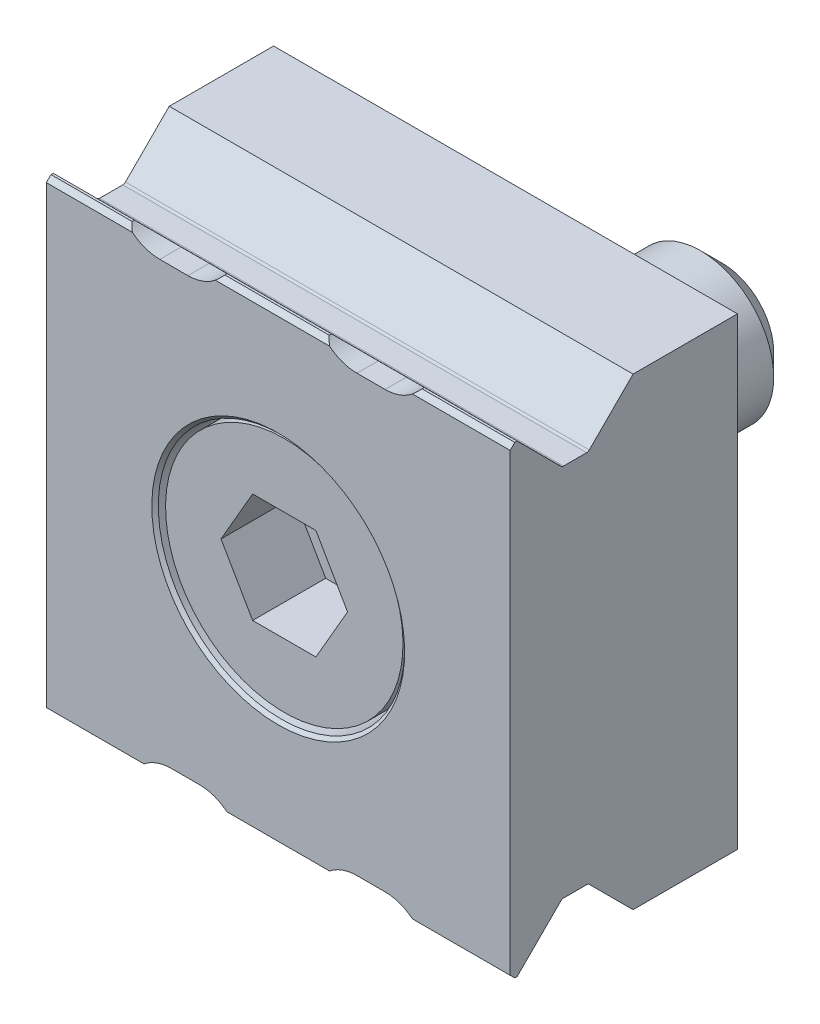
ISO-10303-21;
HEADER;
FILE_DESCRIPTION(('STEP AP214'),'2;1');
FILE_NAME('part.step','',(''),(''),'','','');
FILE_SCHEMA(('AUTOMOTIVE_DESIGN { 1 0 10303 214 1 1 1 1 }'));
ENDSEC;
DATA;
#1=APPLICATION_CONTEXT('core data for automotive mechanical design processes');
#2=APPLICATION_PROTOCOL_DEFINITION('international standard','automotive_design',2000,#1);
#3=PRODUCT_CONTEXT('',#1,'mechanical');
#4=PRODUCT('Part','Part','',(#3));
#5=PRODUCT_RELATED_PRODUCT_CATEGORY('part','',(#4));
#6=PRODUCT_DEFINITION_FORMATION('','',#4);
#7=PRODUCT_DEFINITION_CONTEXT('part definition',#1,'design');
#8=PRODUCT_DEFINITION('design','',#6,#7);
#9=PRODUCT_DEFINITION_SHAPE('','',#8);
#10=(LENGTH_UNIT() NAMED_UNIT(*) SI_UNIT(.MILLI.,.METRE.));
#11=(NAMED_UNIT(*) PLANE_ANGLE_UNIT() SI_UNIT($,.RADIAN.));
#12=(NAMED_UNIT(*) SI_UNIT($,.STERADIAN.) SOLID_ANGLE_UNIT());
#13=UNCERTAINTY_MEASURE_WITH_UNIT(LENGTH_MEASURE(1.E-05),#10,'distance_accuracy_value','');
#14=(GEOMETRIC_REPRESENTATION_CONTEXT(3) GLOBAL_UNCERTAINTY_ASSIGNED_CONTEXT((#13)) GLOBAL_UNIT_ASSIGNED_CONTEXT((#10,
#11,#12)) REPRESENTATION_CONTEXT('',''));
#15=CARTESIAN_POINT('',(0.,0.,0.));
#16=DIRECTION('',(0.,0.,1.));
#17=DIRECTION('',(1.,0.,0.));
#18=AXIS2_PLACEMENT_3D('',#15,#16,#17);
#19=CARTESIAN_POINT('',(0.,0.,-11.6312));
#20=DIRECTION('',(0.,0.,-1.));
#21=DIRECTION('',(0.,-1.,0.));
#22=AXIS2_PLACEMENT_3D('',#19,#20,#21);
#23=PLANE('',#22);
#24=CARTESIAN_POINT('',(0.,0.,-11.6312));
#25=DIRECTION('',(0.,0.,-1.));
#26=DIRECTION('',(0.,-1.,0.));
#27=AXIS2_PLACEMENT_3D('',#24,#25,#26);
#28=CIRCLE('',#27,2.8);
#29=CARTESIAN_POINT('',(0.,-2.8,-11.6312));
#30=VERTEX_POINT('',#29);
#31=EDGE_CURVE('E370',#30,#30,#28,.T.);
#32=ORIENTED_EDGE('',*,*,#31,.T.);
#33=EDGE_LOOP('',(#32));
#34=FACE_BOUND('',#33,.T.);
#35=ADVANCED_FACE('F14',(#34),#23,.T.);
#36=CARTESIAN_POINT('',(0.,0.,-11.6312));
#37=DIRECTION('',(0.,0.,1.));
#38=DIRECTION('',(0.,1.,0.));
#39=AXIS2_PLACEMENT_3D('',#36,#37,#38);
#40=CONICAL_SURFACE('',#39,2.8,0.785398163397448);
#41=CARTESIAN_POINT('',(0.,0.,-10.4312));
#42=DIRECTION('',(0.,0.,-1.));
#43=DIRECTION('',(0.,-1.,0.));
#44=AXIS2_PLACEMENT_3D('',#41,#42,#43);
#45=CIRCLE('',#44,4.);
#46=CARTESIAN_POINT('',(0.,-4.,-10.4312));
#47=VERTEX_POINT('',#46);
#48=EDGE_CURVE('E24',#47,#47,#45,.F.);
#49=ORIENTED_EDGE('',*,*,#48,.F.);
#50=EDGE_LOOP('',(#49));
#51=FACE_BOUND('',#50,.T.);
#52=ORIENTED_EDGE('',*,*,#31,.F.);
#53=EDGE_LOOP('',(#52));
#54=FACE_BOUND('',#53,.T.);
#55=ADVANCED_FACE('F1270',(#51,#54),#40,.T.);
#56=CARTESIAN_POINT('',(0.,0.,9.3688));
#57=DIRECTION('',(0.,0.,1.));
#58=DIRECTION('',(0.,1.,0.));
#59=AXIS2_PLACEMENT_3D('',#56,#57,#58);
#60=CYLINDRICAL_SURFACE('',#59,4.);
#61=ORIENTED_EDGE('',*,*,#48,.T.);
#62=EDGE_LOOP('',(#61));
#63=FACE_BOUND('',#62,.T.);
#64=CARTESIAN_POINT('',(0.,0.,4.3688));
#65=DIRECTION('',(0.,0.,1.));
#66=DIRECTION('',(0.,1.,0.));
#67=AXIS2_PLACEMENT_3D('',#64,#65,#66);
#68=CIRCLE('',#67,4.);
#69=CARTESIAN_POINT('',(0.,4.,4.3688));
#70=VERTEX_POINT('',#69);
#71=EDGE_CURVE('E361',#70,#70,#68,.T.);
#72=ORIENTED_EDGE('',*,*,#71,.F.);
#73=EDGE_LOOP('',(#72));
#74=FACE_BOUND('',#73,.T.);
#75=ADVANCED_FACE('F716',(#63,#74),#60,.T.);
#76=CARTESIAN_POINT('',(0.,6.5,4.3688));
#77=DIRECTION('',(0.,0.,-1.));
#78=DIRECTION('',(0.,-1.,0.));
#79=AXIS2_PLACEMENT_3D('',#76,#77,#78);
#80=PLANE('',#79);
#81=CARTESIAN_POINT('',(0.,0.,4.3688));
#82=DIRECTION('',(0.,0.,-1.));
#83=DIRECTION('',(0.,-1.,0.));
#84=AXIS2_PLACEMENT_3D('',#81,#82,#83);
#85=CIRCLE('',#84,4.3434);
#86=CARTESIAN_POINT('',(0.,-4.3434,4.3688));
#87=VERTEX_POINT('',#86);
#88=EDGE_CURVE('E9',#87,#87,#85,.F.);
#89=ORIENTED_EDGE('',*,*,#88,.F.);
#90=EDGE_LOOP('',(#89));
#91=FACE_BOUND('',#90,.T.);
#92=ORIENTED_EDGE('',*,*,#71,.T.);
#93=EDGE_LOOP('',(#92));
#94=FACE_BOUND('',#93,.T.);
#95=ADVANCED_FACE('F707',(#91,#94),#80,.T.);
#96=CARTESIAN_POINT('',(-3.46410161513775,0.,8.3688));
#97=DIRECTION('',(0.86602540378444,-0.5,0.));
#98=DIRECTION('',(0.5,0.86602540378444,0.));
#99=AXIS2_PLACEMENT_3D('',#96,#97,#98);
#100=PLANE('',#99);
#101=DIRECTION('',(0.,0.,1.));
#102=VECTOR('',#101,1.);
#103=CARTESIAN_POINT('',(-1.73205080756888,3.,8.3688));
#104=LINE('',#103,#102);
#105=CARTESIAN_POINT('',(-1.73205080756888,3.,8.3688));
#106=VERTEX_POINT('',#105);
#107=CARTESIAN_POINT('',(-1.73205080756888,3.,12.3688));
#108=VERTEX_POINT('',#107);
#109=EDGE_CURVE('E290',#106,#108,#104,.T.);
#110=ORIENTED_EDGE('',*,*,#109,.T.);
#111=DIRECTION('',(0.5,0.86602540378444,0.));
#112=VECTOR('',#111,1.);
#113=CARTESIAN_POINT('',(-3.46410161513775,0.,12.3688));
#114=LINE('',#113,#112);
#115=CARTESIAN_POINT('',(-3.46410161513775,0.,12.3688));
#116=VERTEX_POINT('',#115);
#117=EDGE_CURVE('E33',#116,#108,#114,.T.);
#118=ORIENTED_EDGE('',*,*,#117,.F.);
#119=DIRECTION('',(0.,0.,1.));
#120=VECTOR('',#119,1.);
#121=CARTESIAN_POINT('',(-3.46410161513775,0.,8.3688));
#122=LINE('',#121,#120);
#123=CARTESIAN_POINT('',(-3.46410161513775,0.,8.3688));
#124=VERTEX_POINT('',#123);
#125=EDGE_CURVE('E329',#124,#116,#122,.T.);
#126=ORIENTED_EDGE('',*,*,#125,.F.);
#127=DIRECTION('',(0.5,0.86602540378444,0.));
#128=VECTOR('',#127,1.);
#129=CARTESIAN_POINT('',(-3.46410161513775,0.,8.3688));
#130=LINE('',#129,#128);
#131=EDGE_CURVE('E342',#124,#106,#130,.T.);
#132=ORIENTED_EDGE('',*,*,#131,.T.);
#133=EDGE_LOOP('',(#110,#118,#126,#132));
#134=FACE_BOUND('',#133,.T.);
#135=ADVANCED_FACE('F705',(#134),#100,.T.);
#136=CARTESIAN_POINT('',(1.73205080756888,3.,8.3688));
#137=DIRECTION('',(0.,1.,0.));
#138=DIRECTION('',(0.,0.,-1.));
#139=AXIS2_PLACEMENT_3D('',#136,#137,#138);
#140=PLANE('',#139);
#141=DIRECTION('',(0.,0.,1.));
#142=VECTOR('',#141,1.);
#143=CARTESIAN_POINT('',(1.73205080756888,3.,8.3688));
#144=LINE('',#143,#142);
#145=CARTESIAN_POINT('',(1.73205080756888,3.,8.3688));
#146=VERTEX_POINT('',#145);
#147=CARTESIAN_POINT('',(1.73205080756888,3.,12.3688));
#148=VERTEX_POINT('',#147);
#149=EDGE_CURVE('E358',#146,#148,#144,.T.);
#150=ORIENTED_EDGE('',*,*,#149,.T.);
#151=DIRECTION('',(-1.,0.,0.));
#152=VECTOR('',#151,1.);
#153=CARTESIAN_POINT('',(1.73205080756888,3.,12.3688));
#154=LINE('',#153,#152);
#155=EDGE_CURVE('E682',#148,#108,#154,.T.);
#156=ORIENTED_EDGE('',*,*,#155,.T.);
#157=ORIENTED_EDGE('',*,*,#109,.F.);
#158=DIRECTION('',(-1.,0.,0.));
#159=VECTOR('',#158,1.);
#160=CARTESIAN_POINT('',(1.73205080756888,3.,8.3688));
#161=LINE('',#160,#159);
#162=EDGE_CURVE('E352',#146,#106,#161,.T.);
#163=ORIENTED_EDGE('',*,*,#162,.F.);
#164=EDGE_LOOP('',(#150,#156,#157,#163));
#165=FACE_BOUND('',#164,.T.);
#166=ADVANCED_FACE('F704',(#165),#140,.F.);
#167=CARTESIAN_POINT('',(3.46410161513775,0.,8.3688));
#168=DIRECTION('',(0.86602540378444,0.5,0.));
#169=DIRECTION('',(-0.5,0.86602540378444,0.));
#170=AXIS2_PLACEMENT_3D('',#167,#168,#169);
#171=PLANE('',#170);
#172=DIRECTION('',(0.,0.,1.));
#173=VECTOR('',#172,1.);
#174=CARTESIAN_POINT('',(3.46410161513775,0.,8.3688));
#175=LINE('',#174,#173);
#176=CARTESIAN_POINT('',(3.46410161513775,0.,8.3688));
#177=VERTEX_POINT('',#176);
#178=CARTESIAN_POINT('',(3.46410161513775,0.,12.3688));
#179=VERTEX_POINT('',#178);
#180=EDGE_CURVE('E356',#177,#179,#175,.T.);
#181=ORIENTED_EDGE('',*,*,#180,.T.);
#182=DIRECTION('',(-0.5,0.86602540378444,0.));
#183=VECTOR('',#182,1.);
#184=CARTESIAN_POINT('',(3.46410161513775,0.,12.3688));
#185=LINE('',#184,#183);
#186=EDGE_CURVE('E685',#179,#148,#185,.T.);
#187=ORIENTED_EDGE('',*,*,#186,.T.);
#188=ORIENTED_EDGE('',*,*,#149,.F.);
#189=DIRECTION('',(-0.5,0.86602540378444,0.));
#190=VECTOR('',#189,1.);
#191=CARTESIAN_POINT('',(3.46410161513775,0.,8.3688));
#192=LINE('',#191,#190);
#193=EDGE_CURVE('E349',#177,#146,#192,.T.);
#194=ORIENTED_EDGE('',*,*,#193,.F.);
#195=EDGE_LOOP('',(#181,#187,#188,#194));
#196=FACE_BOUND('',#195,.T.);
#197=ADVANCED_FACE('F703',(#196),#171,.F.);
#198=CARTESIAN_POINT('',(3.46410161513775,0.,8.3688));
#199=DIRECTION('',(-0.86602540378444,0.5,0.));
#200=DIRECTION('',(-0.5,-0.86602540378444,0.));
#201=AXIS2_PLACEMENT_3D('',#198,#199,#200);
#202=PLANE('',#201);
#203=DIRECTION('',(0.,0.,1.));
#204=VECTOR('',#203,1.);
#205=CARTESIAN_POINT('',(1.73205080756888,-3.,8.3688));
#206=LINE('',#205,#204);
#207=CARTESIAN_POINT('',(1.73205080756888,-3.,8.3688));
#208=VERTEX_POINT('',#207);
#209=CARTESIAN_POINT('',(1.73205080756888,-3.,12.3688));
#210=VERTEX_POINT('',#209);
#211=EDGE_CURVE('E328',#208,#210,#206,.T.);
#212=ORIENTED_EDGE('',*,*,#211,.T.);
#213=DIRECTION('',(-0.5,-0.86602540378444,0.));
#214=VECTOR('',#213,1.);
#215=CARTESIAN_POINT('',(3.46410161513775,0.,12.3688));
#216=LINE('',#215,#214);
#217=EDGE_CURVE('E688',#179,#210,#216,.T.);
#218=ORIENTED_EDGE('',*,*,#217,.F.);
#219=ORIENTED_EDGE('',*,*,#180,.F.);
#220=DIRECTION('',(-0.5,-0.86602540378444,0.));
#221=VECTOR('',#220,1.);
#222=CARTESIAN_POINT('',(3.46410161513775,0.,8.3688));
#223=LINE('',#222,#221);
#224=EDGE_CURVE('E337',#177,#208,#223,.T.);
#225=ORIENTED_EDGE('',*,*,#224,.T.);
#226=EDGE_LOOP('',(#212,#218,#219,#225));
#227=FACE_BOUND('',#226,.T.);
#228=ADVANCED_FACE('F699',(#227),#202,.T.);
#229=CARTESIAN_POINT('',(-1.73205080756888,-3.,8.3688));
#230=DIRECTION('',(0.,-1.,0.));
#231=DIRECTION('',(1.,0.,0.));
#232=AXIS2_PLACEMENT_3D('',#229,#230,#231);
#233=PLANE('',#232);
#234=DIRECTION('',(0.,0.,1.));
#235=VECTOR('',#234,1.);
#236=CARTESIAN_POINT('',(-1.73205080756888,-3.,8.3688));
#237=LINE('',#236,#235);
#238=CARTESIAN_POINT('',(-1.73205080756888,-3.,8.3688));
#239=VERTEX_POINT('',#238);
#240=CARTESIAN_POINT('',(-1.73205080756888,-3.,12.3688));
#241=VERTEX_POINT('',#240);
#242=EDGE_CURVE('E318',#239,#241,#237,.T.);
#243=ORIENTED_EDGE('',*,*,#242,.T.);
#244=DIRECTION('',(1.,0.,0.));
#245=VECTOR('',#244,1.);
#246=CARTESIAN_POINT('',(-1.73205080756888,-3.,12.3688));
#247=LINE('',#246,#245);
#248=EDGE_CURVE('E693',#241,#210,#247,.T.);
#249=ORIENTED_EDGE('',*,*,#248,.T.);
#250=ORIENTED_EDGE('',*,*,#211,.F.);
#251=DIRECTION('',(1.,0.,0.));
#252=VECTOR('',#251,1.);
#253=CARTESIAN_POINT('',(-1.73205080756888,-3.,8.3688));
#254=LINE('',#253,#252);
#255=EDGE_CURVE('E332',#239,#208,#254,.T.);
#256=ORIENTED_EDGE('',*,*,#255,.F.);
#257=EDGE_LOOP('',(#243,#249,#250,#256));
#258=FACE_BOUND('',#257,.T.);
#259=ADVANCED_FACE('F333',(#258),#233,.F.);
#260=CARTESIAN_POINT('',(-3.46410161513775,0.,8.3688));
#261=DIRECTION('',(-0.86602540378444,-0.5,0.));
#262=DIRECTION('',(0.5,-0.86602540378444,0.));
#263=AXIS2_PLACEMENT_3D('',#260,#261,#262);
#264=PLANE('',#263);
#265=DIRECTION('',(0.5,-0.86602540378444,0.));
#266=VECTOR('',#265,1.);
#267=CARTESIAN_POINT('',(-3.46410161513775,0.,8.3688));
#268=LINE('',#267,#266);
#269=EDGE_CURVE('E322',#124,#239,#268,.T.);
#270=ORIENTED_EDGE('',*,*,#269,.F.);
#271=ORIENTED_EDGE('',*,*,#125,.T.);
#272=DIRECTION('',(0.5,-0.86602540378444,0.));
#273=VECTOR('',#272,1.);
#274=CARTESIAN_POINT('',(-3.46410161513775,0.,12.3688));
#275=LINE('',#274,#273);
#276=EDGE_CURVE('E324',#116,#241,#275,.T.);
#277=ORIENTED_EDGE('',*,*,#276,.T.);
#278=ORIENTED_EDGE('',*,*,#242,.F.);
#279=EDGE_LOOP('',(#270,#271,#277,#278));
#280=FACE_BOUND('',#279,.T.);
#281=ADVANCED_FACE('F320',(#280),#264,.F.);
#282=CARTESIAN_POINT('',(-5.19615242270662,-3.,8.3688));
#283=DIRECTION('',(0.,0.,-1.));
#284=DIRECTION('',(0.,-1.,0.));
#285=AXIS2_PLACEMENT_3D('',#282,#283,#284);
#286=PLANE('',#285);
#287=ORIENTED_EDGE('',*,*,#131,.F.);
#288=ORIENTED_EDGE('',*,*,#269,.T.);
#289=ORIENTED_EDGE('',*,*,#255,.T.);
#290=ORIENTED_EDGE('',*,*,#224,.F.);
#291=ORIENTED_EDGE('',*,*,#193,.T.);
#292=ORIENTED_EDGE('',*,*,#162,.T.);
#293=EDGE_LOOP('',(#287,#288,#289,#290,#291,#292));
#294=FACE_BOUND('',#293,.T.);
#295=ADVANCED_FACE('F340',(#294),#286,.F.);
#296=CARTESIAN_POINT('',(0.,0.,12.3688));
#297=DIRECTION('',(0.,0.,1.));
#298=DIRECTION('',(0.,1.,0.));
#299=AXIS2_PLACEMENT_3D('',#296,#297,#298);
#300=PLANE('',#299);
#301=CARTESIAN_POINT('',(0.,0.,12.3688));
#302=DIRECTION('',(0.,0.,1.));
#303=DIRECTION('',(0.,1.,0.));
#304=AXIS2_PLACEMENT_3D('',#301,#302,#303);
#305=CIRCLE('',#304,6.5);
#306=CARTESIAN_POINT('',(0.,6.5,12.3688));
#307=VERTEX_POINT('',#306);
#308=EDGE_CURVE('E367',#307,#307,#305,.T.);
#309=ORIENTED_EDGE('',*,*,#308,.T.);
#310=EDGE_LOOP('',(#309));
#311=FACE_BOUND('',#310,.T.);
#312=ORIENTED_EDGE('',*,*,#276,.F.);
#313=ORIENTED_EDGE('',*,*,#117,.T.);
#314=ORIENTED_EDGE('',*,*,#155,.F.);
#315=ORIENTED_EDGE('',*,*,#186,.F.);
#316=ORIENTED_EDGE('',*,*,#217,.T.);
#317=ORIENTED_EDGE('',*,*,#248,.F.);
#318=EDGE_LOOP('',(#312,#313,#314,#315,#316,#317));
#319=FACE_BOUND('',#318,.T.);
#320=ADVANCED_FACE('F697',(#311,#319),#300,.T.);
#321=CARTESIAN_POINT('',(0.,0.,9.3688));
#322=DIRECTION('',(0.,0.,1.));
#323=DIRECTION('',(0.,1.,0.));
#324=AXIS2_PLACEMENT_3D('',#321,#322,#323);
#325=CYLINDRICAL_SURFACE('',#324,6.5);
#326=CARTESIAN_POINT('',(0.,0.,4.3688));
#327=DIRECTION('',(0.,0.,1.));
#328=DIRECTION('',(0.,1.,0.));
#329=AXIS2_PLACEMENT_3D('',#326,#327,#328);
#330=CIRCLE('',#329,6.5);
#331=CARTESIAN_POINT('',(0.,6.5,4.3688));
#332=VERTEX_POINT('',#331);
#333=EDGE_CURVE('E364',#332,#332,#330,.T.);
#334=ORIENTED_EDGE('',*,*,#333,.T.);
#335=EDGE_LOOP('',(#334));
#336=FACE_BOUND('',#335,.T.);
#337=ORIENTED_EDGE('',*,*,#308,.F.);
#338=EDGE_LOOP('',(#337));
#339=FACE_BOUND('',#338,.T.);
#340=ADVANCED_FACE('F746',(#336,#339),#325,.T.);
#341=CARTESIAN_POINT('',(12.7,-12.7,0.));
#342=DIRECTION('',(0.,1.,0.));
#343=DIRECTION('',(-1.,0.,0.));
#344=AXIS2_PLACEMENT_3D('',#341,#342,#343);
#345=PLANE('',#344);
#346=DIRECTION('',(0.,0.,1.));
#347=VECTOR('',#346,1.);
#348=CARTESIAN_POINT('',(2.54,-12.7,9.525));
#349=LINE('',#348,#347);
#350=CARTESIAN_POINT('',(2.54,-12.7,12.446));
#351=VERTEX_POINT('',#350);
#352=CARTESIAN_POINT('',(2.54,-12.7,12.3189998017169));
#353=VERTEX_POINT('',#352);
#354=EDGE_CURVE('E389',#351,#353,#349,.F.);
#355=ORIENTED_EDGE('',*,*,#354,.F.);
#356=DIRECTION('',(-1.,0.,0.));
#357=VECTOR('',#356,1.);
#358=CARTESIAN_POINT('',(12.7,-12.7,12.446));
#359=LINE('',#358,#357);
#360=CARTESIAN_POINT('',(-2.54,-12.7,12.446));
#361=VERTEX_POINT('',#360);
#362=EDGE_CURVE('E632',#351,#361,#359,.T.);
#363=ORIENTED_EDGE('',*,*,#362,.T.);
#364=DIRECTION('',(0.,0.,1.));
#365=VECTOR('',#364,1.);
#366=CARTESIAN_POINT('',(-2.54,-12.7,9.525));
#367=LINE('',#366,#365);
#368=CARTESIAN_POINT('',(-2.54,-12.7,12.3189998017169));
#369=VERTEX_POINT('',#368);
#370=EDGE_CURVE('E409',#369,#361,#367,.T.);
#371=ORIENTED_EDGE('',*,*,#370,.F.);
#372=DIRECTION('',(-1.,0.,0.));
#373=VECTOR('',#372,1.);
#374=CARTESIAN_POINT('',(12.7,-12.7,12.3189998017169));
#375=LINE('',#374,#373);
#376=EDGE_CURVE('E506',#353,#369,#375,.T.);
#377=ORIENTED_EDGE('',*,*,#376,.F.);
#378=EDGE_LOOP('',(#355,#363,#371,#377));
#379=FACE_BOUND('',#378,.T.);
#380=ADVANCED_FACE('F727',(#379),#345,.F.);
#381=DIRECTION('',(0.,0.,1.));
#382=VECTOR('',#381,1.);
#383=CARTESIAN_POINT('',(-7.62,-12.7,9.525));
#384=LINE('',#383,#382);
#385=CARTESIAN_POINT('',(-7.62,-12.7,12.446));
#386=VERTEX_POINT('',#385);
#387=CARTESIAN_POINT('',(-7.62,-12.7,12.3189998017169));
#388=VERTEX_POINT('',#387);
#389=EDGE_CURVE('E407',#386,#388,#384,.F.);
#390=ORIENTED_EDGE('',*,*,#389,.F.);
#391=DIRECTION('',(-1.,0.,0.));
#392=VECTOR('',#391,1.);
#393=CARTESIAN_POINT('',(12.7,-12.7,12.446));
#394=LINE('',#393,#392);
#395=CARTESIAN_POINT('',(-12.7,-12.7,12.446));
#396=VERTEX_POINT('',#395);
#397=EDGE_CURVE('E639',#386,#396,#394,.T.);
#398=ORIENTED_EDGE('',*,*,#397,.T.);
#399=DIRECTION('',(0.,0.,1.));
#400=VECTOR('',#399,1.);
#401=CARTESIAN_POINT('',(-12.7,-12.7,0.));
#402=LINE('',#401,#400);
#403=CARTESIAN_POINT('',(-12.7,-12.7,12.3189998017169));
#404=VERTEX_POINT('',#403);
#405=EDGE_CURVE('E523',#404,#396,#402,.T.);
#406=ORIENTED_EDGE('',*,*,#405,.F.);
#407=EDGE_CURVE('E501',#388,#404,#375,.T.);
#408=ORIENTED_EDGE('',*,*,#407,.F.);
#409=EDGE_LOOP('',(#390,#398,#406,#408));
#410=FACE_BOUND('',#409,.T.);
#411=ADVANCED_FACE('F735',(#410),#345,.F.);
#412=CARTESIAN_POINT('',(-12.7,12.7,0.));
#413=DIRECTION('',(0.,-1.,0.));
#414=DIRECTION('',(1.,0.,0.));
#415=AXIS2_PLACEMENT_3D('',#412,#413,#414);
#416=PLANE('',#415);
#417=DIRECTION('',(0.,0.,1.));
#418=VECTOR('',#417,1.);
#419=CARTESIAN_POINT('',(-12.7,12.7,0.));
#420=LINE('',#419,#418);
#421=CARTESIAN_POINT('',(-12.7,12.7,12.3189998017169));
#422=VERTEX_POINT('',#421);
#423=CARTESIAN_POINT('',(-12.7,12.7,12.446));
#424=VERTEX_POINT('',#423);
#425=EDGE_CURVE('E520',#422,#424,#420,.T.);
#426=ORIENTED_EDGE('',*,*,#425,.T.);
#427=DIRECTION('',(1.,0.,0.));
#428=VECTOR('',#427,1.);
#429=CARTESIAN_POINT('',(-12.7,12.7,12.446));
#430=LINE('',#429,#428);
#431=CARTESIAN_POINT('',(-8.255,12.7,12.446));
#432=VERTEX_POINT('',#431);
#433=EDGE_CURVE('E644',#424,#432,#430,.T.);
#434=ORIENTED_EDGE('',*,*,#433,.T.);
#435=DIRECTION('',(0.,0.,1.));
#436=VECTOR('',#435,1.);
#437=CARTESIAN_POINT('',(-8.255,12.7,9.525));
#438=LINE('',#437,#436);
#439=CARTESIAN_POINT('',(-8.255,12.7,12.3189998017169));
#440=VERTEX_POINT('',#439);
#441=EDGE_CURVE('E428',#432,#440,#438,.F.);
#442=ORIENTED_EDGE('',*,*,#441,.T.);
#443=DIRECTION('',(-1.,0.,0.));
#444=VECTOR('',#443,1.);
#445=CARTESIAN_POINT('',(-12.7,12.7,12.3189998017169));
#446=LINE('',#445,#444);
#447=EDGE_CURVE('E545',#440,#422,#446,.T.);
#448=ORIENTED_EDGE('',*,*,#447,.T.);
#449=EDGE_LOOP('',(#426,#434,#442,#448));
#450=FACE_BOUND('',#449,.T.);
#451=ADVANCED_FACE('F753',(#450),#416,.F.);
#452=DIRECTION('',(0.,0.,1.));
#453=VECTOR('',#452,1.);
#454=CARTESIAN_POINT('',(-3.175,12.7,9.525));
#455=LINE('',#454,#453);
#456=CARTESIAN_POINT('',(-3.175,12.7,12.3189998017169));
#457=VERTEX_POINT('',#456);
#458=CARTESIAN_POINT('',(-3.175,12.7,12.446));
#459=VERTEX_POINT('',#458);
#460=EDGE_CURVE('E425',#457,#459,#455,.T.);
#461=ORIENTED_EDGE('',*,*,#460,.T.);
#462=DIRECTION('',(1.,0.,0.));
#463=VECTOR('',#462,1.);
#464=CARTESIAN_POINT('',(-12.7,12.7,12.446));
#465=LINE('',#464,#463);
#466=CARTESIAN_POINT('',(2.54,12.7,12.446));
#467=VERTEX_POINT('',#466);
#468=EDGE_CURVE('E649',#459,#467,#465,.T.);
#469=ORIENTED_EDGE('',*,*,#468,.T.);
#470=DIRECTION('',(0.,0.,1.));
#471=VECTOR('',#470,1.);
#472=CARTESIAN_POINT('',(2.54,12.7,9.525));
#473=LINE('',#472,#471);
#474=CARTESIAN_POINT('',(2.54,12.7,12.3189998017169));
#475=VERTEX_POINT('',#474);
#476=EDGE_CURVE('E444',#467,#475,#473,.F.);
#477=ORIENTED_EDGE('',*,*,#476,.T.);
#478=EDGE_CURVE('E550',#475,#457,#446,.T.);
#479=ORIENTED_EDGE('',*,*,#478,.T.);
#480=EDGE_LOOP('',(#461,#469,#477,#479));
#481=FACE_BOUND('',#480,.T.);
#482=ADVANCED_FACE('F827',(#481),#416,.F.);
#483=CARTESIAN_POINT('',(12.71,-10.3029365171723,8.36606353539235));
#484=DIRECTION('',(0.,0.707106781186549,-0.707106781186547));
#485=DIRECTION('',(0.,-0.707106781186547,-0.707106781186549));
#486=AXIS2_PLACEMENT_3D('',#483,#484,#485);
#487=PLANE('',#486);
#488=DIRECTION('',(-1.,0.,0.));
#489=VECTOR('',#488,1.);
#490=CARTESIAN_POINT('',(12.71,-10.3029365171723,8.36606353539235));
#491=LINE('',#490,#489);
#492=CARTESIAN_POINT('',(12.7,-10.3029365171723,8.36606353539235));
#493=VERTEX_POINT('',#492);
#494=CARTESIAN_POINT('',(-12.7,-10.3029365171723,8.36606353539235));
#495=VERTEX_POINT('',#494);
#496=EDGE_CURVE('E476',#493,#495,#491,.T.);
#497=ORIENTED_EDGE('',*,*,#496,.T.);
#498=DIRECTION('',(0.,0.707106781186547,0.707106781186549));
#499=VECTOR('',#498,1.);
#500=CARTESIAN_POINT('',(-12.7,-15.6845000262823,2.9845000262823));
#501=LINE('',#500,#499);
#502=CARTESIAN_POINT('',(-12.7,-12.7,5.96900005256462));
#503=VERTEX_POINT('',#502);
#504=EDGE_CURVE('E529',#503,#495,#501,.T.);
#505=ORIENTED_EDGE('',*,*,#504,.F.);
#506=DIRECTION('',(-1.,0.,0.));
#507=VECTOR('',#506,1.);
#508=CARTESIAN_POINT('',(12.7,-12.7,5.96900005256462));
#509=LINE('',#508,#507);
#510=CARTESIAN_POINT('',(12.7,-12.7,5.96900005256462));
#511=VERTEX_POINT('',#510);
#512=EDGE_CURVE('E480',#511,#503,#509,.T.);
#513=ORIENTED_EDGE('',*,*,#512,.F.);
#514=DIRECTION('',(0.,-0.707106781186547,-0.707106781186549));
#515=VECTOR('',#514,1.);
#516=CARTESIAN_POINT('',(12.7,-2.98450002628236,15.6845000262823));
#517=LINE('',#516,#515);
#518=EDGE_CURVE('E490',#493,#511,#517,.T.);
#519=ORIENTED_EDGE('',*,*,#518,.F.);
#520=EDGE_LOOP('',(#497,#505,#513,#519));
#521=FACE_BOUND('',#520,.T.);
#522=ADVANCED_FACE('F841',(#521),#487,.F.);
#523=CARTESIAN_POINT('',(12.71,-10.4466206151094,8.50974763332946));
#524=DIRECTION('',(-1.,0.,0.));
#525=DIRECTION('',(0.,-1.,0.));
#526=AXIS2_PLACEMENT_3D('',#523,#524,#525);
#527=CYLINDRICAL_SURFACE('',#526,0.203200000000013);
#528=DIRECTION('',(-1.,0.,0.));
#529=VECTOR('',#528,1.);
#530=CARTESIAN_POINT('',(12.71,-10.2434206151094,8.50974763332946));
#531=LINE('',#530,#529);
#532=CARTESIAN_POINT('',(12.7,-10.2434206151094,8.50974763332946));
#533=VERTEX_POINT('',#532);
#534=CARTESIAN_POINT('',(-12.7,-10.2434206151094,8.50974763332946));
#535=VERTEX_POINT('',#534);
#536=EDGE_CURVE('E484',#533,#535,#531,.T.);
#537=ORIENTED_EDGE('',*,*,#536,.T.);
#538=CARTESIAN_POINT('',(-12.7,-10.4466206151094,8.50974763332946));
#539=DIRECTION('',(1.,0.,0.));
#540=DIRECTION('',(0.,1.,0.));
#541=AXIS2_PLACEMENT_3D('',#538,#539,#540);
#542=CIRCLE('',#541,0.203200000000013);
#543=EDGE_CURVE('E532',#495,#535,#542,.T.);
#544=ORIENTED_EDGE('',*,*,#543,.F.);
#545=ORIENTED_EDGE('',*,*,#496,.F.);
#546=CARTESIAN_POINT('',(12.7,-10.4466206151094,8.50974763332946));
#547=DIRECTION('',(-1.,0.,0.));
#548=DIRECTION('',(0.,-1.,0.));
#549=AXIS2_PLACEMENT_3D('',#546,#547,#548);
#550=CIRCLE('',#549,0.203200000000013);
#551=EDGE_CURVE('E493',#533,#493,#550,.T.);
#552=ORIENTED_EDGE('',*,*,#551,.F.);
#553=EDGE_LOOP('',(#537,#544,#545,#552));
#554=FACE_BOUND('',#553,.T.);
#555=ADVANCED_FACE('F848',(#554),#527,.F.);
#556=CARTESIAN_POINT('',(12.71,-10.2434206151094,8.50974763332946));
#557=DIRECTION('',(0.,-1.,0.));
#558=DIRECTION('',(1.,0.,0.));
#559=AXIS2_PLACEMENT_3D('',#556,#557,#558);
#560=PLANE('',#559);
#561=DIRECTION('',(0.,0.,1.));
#562=VECTOR('',#561,1.);
#563=CARTESIAN_POINT('',(12.7,-10.2434206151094,0.));
#564=LINE('',#563,#562);
#565=CARTESIAN_POINT('',(12.7,-10.2434206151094,9.77825222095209));
#566=VERTEX_POINT('',#565);
#567=EDGE_CURVE('E496',#533,#566,#564,.T.);
#568=ORIENTED_EDGE('',*,*,#567,.T.);
#569=DIRECTION('',(-1.,0.,0.));
#570=VECTOR('',#569,1.);
#571=CARTESIAN_POINT('',(12.71,-10.2434206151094,9.77825222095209));
#572=LINE('',#571,#570);
#573=CARTESIAN_POINT('',(-12.7,-10.2434206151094,9.77825222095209));
#574=VERTEX_POINT('',#573);
#575=EDGE_CURVE('E481',#566,#574,#572,.T.);
#576=ORIENTED_EDGE('',*,*,#575,.T.);
#577=DIRECTION('',(0.,0.,-1.));
#578=VECTOR('',#577,1.);
#579=CARTESIAN_POINT('',(-12.7,-10.2434206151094,0.));
#580=LINE('',#579,#578);
#581=EDGE_CURVE('E535',#574,#535,#580,.T.);
#582=ORIENTED_EDGE('',*,*,#581,.T.);
#583=ORIENTED_EDGE('',*,*,#536,.F.);
#584=EDGE_LOOP('',(#568,#576,#582,#583));
#585=FACE_BOUND('',#584,.T.);
#586=ADVANCED_FACE('F928',(#585),#560,.T.);
#587=CARTESIAN_POINT('',(12.71,-10.4466206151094,9.77825222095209));
#588=DIRECTION('',(-1.,0.,0.));
#589=DIRECTION('',(0.,-1.,0.));
#590=AXIS2_PLACEMENT_3D('',#587,#588,#589);
#591=CYLINDRICAL_SURFACE('',#590,0.203199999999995);
#592=DIRECTION('',(-1.,0.,0.));
#593=VECTOR('',#592,1.);
#594=CARTESIAN_POINT('',(12.71,-10.3029365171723,9.9219363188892));
#595=LINE('',#594,#593);
#596=CARTESIAN_POINT('',(12.7,-10.3029365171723,9.9219363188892));
#597=VERTEX_POINT('',#596);
#598=CARTESIAN_POINT('',(-12.7,-10.3029365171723,9.9219363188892));
#599=VERTEX_POINT('',#598);
#600=EDGE_CURVE('E477',#597,#599,#595,.T.);
#601=ORIENTED_EDGE('',*,*,#600,.T.);
#602=CARTESIAN_POINT('',(-12.7,-10.4466206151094,9.77825222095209));
#603=DIRECTION('',(1.,0.,0.));
#604=DIRECTION('',(0.,1.,0.));
#605=AXIS2_PLACEMENT_3D('',#602,#603,#604);
#606=CIRCLE('',#605,0.203199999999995);
#607=EDGE_CURVE('E537',#574,#599,#606,.T.);
#608=ORIENTED_EDGE('',*,*,#607,.F.);
#609=ORIENTED_EDGE('',*,*,#575,.F.);
#610=CARTESIAN_POINT('',(12.7,-10.4466206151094,9.77825222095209));
#611=DIRECTION('',(-1.,0.,0.));
#612=DIRECTION('',(0.,-1.,0.));
#613=AXIS2_PLACEMENT_3D('',#610,#611,#612);
#614=CIRCLE('',#613,0.203199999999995);
#615=EDGE_CURVE('E498',#597,#566,#614,.T.);
#616=ORIENTED_EDGE('',*,*,#615,.F.);
#617=EDGE_LOOP('',(#601,#608,#609,#616));
#618=FACE_BOUND('',#617,.T.);
#619=ADVANCED_FACE('F781',(#618),#591,.F.);
#620=DIRECTION('',(0.,0.,1.));
#621=VECTOR('',#620,1.);
#622=CARTESIAN_POINT('',(7.62,12.7,9.525));
#623=LINE('',#622,#621);
#624=CARTESIAN_POINT('',(7.62,12.7,12.3189998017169));
#625=VERTEX_POINT('',#624);
#626=CARTESIAN_POINT('',(7.62,12.7,12.446));
#627=VERTEX_POINT('',#626);
#628=EDGE_CURVE('E442',#625,#627,#623,.T.);
#629=ORIENTED_EDGE('',*,*,#628,.T.);
#630=DIRECTION('',(1.,0.,0.));
#631=VECTOR('',#630,1.);
#632=CARTESIAN_POINT('',(-12.7,12.7,12.446));
#633=LINE('',#632,#631);
#634=CARTESIAN_POINT('',(12.7,12.7,12.446));
#635=VERTEX_POINT('',#634);
#636=EDGE_CURVE('E654',#627,#635,#633,.T.);
#637=ORIENTED_EDGE('',*,*,#636,.T.);
#638=DIRECTION('',(0.,0.,1.));
#639=VECTOR('',#638,1.);
#640=CARTESIAN_POINT('',(12.7,12.7,0.));
#641=LINE('',#640,#639);
#642=CARTESIAN_POINT('',(12.7,12.7,12.3189998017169));
#643=VERTEX_POINT('',#642);
#644=EDGE_CURVE('E515',#643,#635,#641,.T.);
#645=ORIENTED_EDGE('',*,*,#644,.F.);
#646=EDGE_CURVE('E546',#643,#625,#446,.T.);
#647=ORIENTED_EDGE('',*,*,#646,.T.);
#648=EDGE_LOOP('',(#629,#637,#645,#647));
#649=FACE_BOUND('',#648,.T.);
#650=ADVANCED_FACE('F736',(#649),#416,.F.);
#651=CARTESIAN_POINT('',(12.71,10.3029365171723,9.9219363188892));
#652=DIRECTION('',(0.,-0.707106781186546,0.707106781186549));
#653=DIRECTION('',(0.,0.707106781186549,0.707106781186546));
#654=AXIS2_PLACEMENT_3D('',#651,#652,#653);
#655=PLANE('',#654);
#656=ORIENTED_EDGE('',*,*,#447,.F.);
#657=CARTESIAN_POINT('',(-6.48582116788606,14.29385,13.9128498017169));
#658=DIRECTION('',(0.,-0.707106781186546,0.707106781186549));
#659=DIRECTION('',(0.,0.707106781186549,0.707106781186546));
#660=AXIS2_PLACEMENT_3D('',#657,#658,#659);
#661=ELLIPSE('',#660,3.36759604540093,2.38125);
#662=CARTESIAN_POINT('',(-6.48582116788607,11.9126,11.5315998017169));
#663=VERTEX_POINT('',#662);
#664=EDGE_CURVE('E570',#440,#663,#661,.T.);
#665=ORIENTED_EDGE('',*,*,#664,.T.);
#666=DIRECTION('',(-1.,0.,0.));
#667=VECTOR('',#666,1.);
#668=CARTESIAN_POINT('',(12.71,11.9126,11.5315998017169));
#669=LINE('',#668,#667);
#670=CARTESIAN_POINT('',(-4.94417883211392,11.9126,11.5315998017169));
#671=VERTEX_POINT('',#670);
#672=EDGE_CURVE('E568',#671,#663,#669,.T.);
#673=ORIENTED_EDGE('',*,*,#672,.F.);
#674=CARTESIAN_POINT('',(-4.94417883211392,14.29385,13.9128498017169));
#675=DIRECTION('',(0.,-0.707106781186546,0.707106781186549));
#676=DIRECTION('',(0.,0.707106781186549,0.707106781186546));
#677=AXIS2_PLACEMENT_3D('',#674,#675,#676);
#678=ELLIPSE('',#677,3.36759604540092,2.38125);
#679=EDGE_CURVE('E565',#671,#457,#678,.T.);
#680=ORIENTED_EDGE('',*,*,#679,.T.);
#681=ORIENTED_EDGE('',*,*,#478,.F.);
#682=CARTESIAN_POINT('',(4.30917883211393,14.29385,13.9128498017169));
#683=DIRECTION('',(0.,-0.707106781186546,0.707106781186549));
#684=DIRECTION('',(0.,0.707106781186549,0.707106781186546));
#685=AXIS2_PLACEMENT_3D('',#682,#683,#684);
#686=ELLIPSE('',#685,3.36759604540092,2.38125);
#687=CARTESIAN_POINT('',(4.30917883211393,11.9126,11.5315998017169));
#688=VERTEX_POINT('',#687);
#689=EDGE_CURVE('E562',#475,#688,#686,.T.);
#690=ORIENTED_EDGE('',*,*,#689,.T.);
#691=DIRECTION('',(-1.,0.,0.));
#692=VECTOR('',#691,1.);
#693=CARTESIAN_POINT('',(12.71,11.9126,11.5315998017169));
#694=LINE('',#693,#692);
#695=CARTESIAN_POINT('',(5.85082116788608,11.9126,11.5315998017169));
#696=VERTEX_POINT('',#695);
#697=EDGE_CURVE('E560',#696,#688,#694,.T.);
#698=ORIENTED_EDGE('',*,*,#697,.F.);
#699=CARTESIAN_POINT('',(5.85082116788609,14.29385,13.9128498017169));
#700=DIRECTION('',(0.,-0.707106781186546,0.707106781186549));
#701=DIRECTION('',(0.,0.707106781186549,0.707106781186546));
#702=AXIS2_PLACEMENT_3D('',#699,#700,#701);
#703=ELLIPSE('',#702,3.36759604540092,2.38125);
#704=EDGE_CURVE('E557',#696,#625,#703,.T.);
#705=ORIENTED_EDGE('',*,*,#704,.T.);
#706=ORIENTED_EDGE('',*,*,#646,.F.);
#707=DIRECTION('',(0.,0.707106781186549,0.707106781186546));
#708=VECTOR('',#707,1.);
#709=CARTESIAN_POINT('',(12.7,6.54050009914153,6.15949990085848));
#710=LINE('',#709,#708);
#711=CARTESIAN_POINT('',(12.7,10.3029365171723,9.9219363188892));
#712=VERTEX_POINT('',#711);
#713=EDGE_CURVE('E466',#712,#643,#710,.T.);
#714=ORIENTED_EDGE('',*,*,#713,.F.);
#715=DIRECTION('',(-1.,0.,0.));
#716=VECTOR('',#715,1.);
#717=CARTESIAN_POINT('',(12.71,10.3029365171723,9.9219363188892));
#718=LINE('',#717,#716);
#719=CARTESIAN_POINT('',(-12.7,10.3029365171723,9.9219363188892));
#720=VERTEX_POINT('',#719);
#721=EDGE_CURVE('E455',#712,#720,#718,.T.);
#722=ORIENTED_EDGE('',*,*,#721,.T.);
#723=DIRECTION('',(0.,-0.707106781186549,-0.707106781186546));
#724=VECTOR('',#723,1.);
#725=CARTESIAN_POINT('',(-12.7,-6.15949990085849,-6.5405000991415));
#726=LINE('',#725,#724);
#727=EDGE_CURVE('E463',#422,#720,#726,.T.);
#728=ORIENTED_EDGE('',*,*,#727,.F.);
#729=EDGE_LOOP('',(#656,#665,#673,#680,#681,#690,#698,#705,#706,#714,#722,#728));
#730=FACE_BOUND('',#729,.T.);
#731=ADVANCED_FACE('F780',(#730),#655,.F.);
#732=CARTESIAN_POINT('',(12.71,10.4466206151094,9.77825222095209));
#733=DIRECTION('',(-1.,0.,0.));
#734=DIRECTION('',(0.,-1.,0.));
#735=AXIS2_PLACEMENT_3D('',#732,#733,#734);
#736=CYLINDRICAL_SURFACE('',#735,0.203199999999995);
#737=CARTESIAN_POINT('',(12.7,10.4466206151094,9.77825222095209));
#738=DIRECTION('',(-1.,0.,0.));
#739=DIRECTION('',(0.,-1.,0.));
#740=AXIS2_PLACEMENT_3D('',#737,#738,#739);
#741=CIRCLE('',#740,0.203199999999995);
#742=CARTESIAN_POINT('',(12.7,10.2434206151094,9.77825222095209));
#743=VERTEX_POINT('',#742);
#744=EDGE_CURVE('E474',#712,#743,#741,.F.);
#745=ORIENTED_EDGE('',*,*,#744,.T.);
#746=DIRECTION('',(-1.,0.,0.));
#747=VECTOR('',#746,1.);
#748=CARTESIAN_POINT('',(12.71,10.2434206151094,9.77825222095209));
#749=LINE('',#748,#747);
#750=CARTESIAN_POINT('',(-12.7,10.2434206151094,9.77825222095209));
#751=VERTEX_POINT('',#750);
#752=EDGE_CURVE('E452',#743,#751,#749,.T.);
#753=ORIENTED_EDGE('',*,*,#752,.T.);
#754=CARTESIAN_POINT('',(-12.7,10.4466206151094,9.77825222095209));
#755=DIRECTION('',(1.,0.,0.));
#756=DIRECTION('',(0.,1.,0.));
#757=AXIS2_PLACEMENT_3D('',#754,#755,#756);
#758=CIRCLE('',#757,0.203199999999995);
#759=EDGE_CURVE('E555',#751,#720,#758,.F.);
#760=ORIENTED_EDGE('',*,*,#759,.T.);
#761=ORIENTED_EDGE('',*,*,#721,.F.);
#762=EDGE_LOOP('',(#745,#753,#760,#761));
#763=FACE_BOUND('',#762,.T.);
#764=ADVANCED_FACE('F851',(#763),#736,.F.);
#765=CARTESIAN_POINT('',(12.71,10.2434206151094,8.50974763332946));
#766=DIRECTION('',(0.,-1.,0.));
#767=DIRECTION('',(1.,0.,0.));
#768=AXIS2_PLACEMENT_3D('',#765,#766,#767);
#769=PLANE('',#768);
#770=DIRECTION('',(-1.,0.,0.));
#771=VECTOR('',#770,1.);
#772=CARTESIAN_POINT('',(12.71,10.2434206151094,8.50974763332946));
#773=LINE('',#772,#771);
#774=CARTESIAN_POINT('',(12.7,10.2434206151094,8.50974763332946));
#775=VERTEX_POINT('',#774);
#776=CARTESIAN_POINT('',(-12.7,10.2434206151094,8.50974763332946));
#777=VERTEX_POINT('',#776);
#778=EDGE_CURVE('E449',#775,#777,#773,.T.);
#779=ORIENTED_EDGE('',*,*,#778,.T.);
#780=DIRECTION('',(0.,0.,-1.));
#781=VECTOR('',#780,1.);
#782=CARTESIAN_POINT('',(-12.7,10.2434206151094,0.));
#783=LINE('',#782,#781);
#784=EDGE_CURVE('E552',#751,#777,#783,.T.);
#785=ORIENTED_EDGE('',*,*,#784,.F.);
#786=ORIENTED_EDGE('',*,*,#752,.F.);
#787=DIRECTION('',(0.,0.,1.));
#788=VECTOR('',#787,1.);
#789=CARTESIAN_POINT('',(12.7,10.2434206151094,0.));
#790=LINE('',#789,#788);
#791=EDGE_CURVE('E471',#775,#743,#790,.T.);
#792=ORIENTED_EDGE('',*,*,#791,.F.);
#793=EDGE_LOOP('',(#779,#785,#786,#792));
#794=FACE_BOUND('',#793,.T.);
#795=ADVANCED_FACE('F916',(#794),#769,.F.);
#796=CARTESIAN_POINT('',(12.71,10.4466206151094,8.50974763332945));
#797=DIRECTION('',(-1.,0.,0.));
#798=DIRECTION('',(0.,-1.,0.));
#799=AXIS2_PLACEMENT_3D('',#796,#797,#798);
#800=CYLINDRICAL_SURFACE('',#799,0.2032);
#801=CARTESIAN_POINT('',(12.7,10.4466206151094,8.50974763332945));
#802=DIRECTION('',(-1.,0.,0.));
#803=DIRECTION('',(0.,-1.,0.));
#804=AXIS2_PLACEMENT_3D('',#801,#802,#803);
#805=CIRCLE('',#804,0.2032);
#806=CARTESIAN_POINT('',(12.7,10.3029365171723,8.36606353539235));
#807=VERTEX_POINT('',#806);
#808=EDGE_CURVE('E469',#775,#807,#805,.F.);
#809=ORIENTED_EDGE('',*,*,#808,.T.);
#810=DIRECTION('',(-1.,0.,0.));
#811=VECTOR('',#810,1.);
#812=CARTESIAN_POINT('',(12.71,10.3029365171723,8.36606353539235));
#813=LINE('',#812,#811);
#814=CARTESIAN_POINT('',(-12.7,10.3029365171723,8.36606353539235));
#815=VERTEX_POINT('',#814);
#816=EDGE_CURVE('E446',#807,#815,#813,.T.);
#817=ORIENTED_EDGE('',*,*,#816,.T.);
#818=CARTESIAN_POINT('',(-12.7,10.4466206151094,8.50974763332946));
#819=DIRECTION('',(1.,0.,0.));
#820=DIRECTION('',(0.,1.,0.));
#821=AXIS2_PLACEMENT_3D('',#818,#819,#820);
#822=CIRCLE('',#821,0.2032);
#823=EDGE_CURVE('E549',#815,#777,#822,.F.);
#824=ORIENTED_EDGE('',*,*,#823,.T.);
#825=ORIENTED_EDGE('',*,*,#778,.F.);
#826=EDGE_LOOP('',(#809,#817,#824,#825));
#827=FACE_BOUND('',#826,.T.);
#828=ADVANCED_FACE('F912',(#827),#800,.F.);
#829=CARTESIAN_POINT('',(12.71,10.3029365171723,8.36606353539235));
#830=DIRECTION('',(0.,0.707106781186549,0.707106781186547));
#831=DIRECTION('',(0.,0.707106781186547,-0.707106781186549));
#832=AXIS2_PLACEMENT_3D('',#829,#830,#831);
#833=PLANE('',#832);
#834=DIRECTION('',(0.,0.707106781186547,-0.707106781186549));
#835=VECTOR('',#834,1.);
#836=CARTESIAN_POINT('',(12.7,15.6845000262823,2.9845000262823));
#837=LINE('',#836,#835);
#838=CARTESIAN_POINT('',(12.7,12.7,5.96900005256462));
#839=VERTEX_POINT('',#838);
#840=EDGE_CURVE('E460',#807,#839,#837,.T.);
#841=ORIENTED_EDGE('',*,*,#840,.T.);
#842=DIRECTION('',(-1.,0.,0.));
#843=VECTOR('',#842,1.);
#844=CARTESIAN_POINT('',(-12.7,12.7,5.96900005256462));
#845=LINE('',#844,#843);
#846=CARTESIAN_POINT('',(-12.7,12.7,5.96900005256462));
#847=VERTEX_POINT('',#846);
#848=EDGE_CURVE('E542',#839,#847,#845,.T.);
#849=ORIENTED_EDGE('',*,*,#848,.T.);
#850=DIRECTION('',(0.,-0.707106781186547,0.707106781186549));
#851=VECTOR('',#850,1.);
#852=CARTESIAN_POINT('',(-12.7,2.98450002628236,15.6845000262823));
#853=LINE('',#852,#851);
#854=EDGE_CURVE('E458',#847,#815,#853,.T.);
#855=ORIENTED_EDGE('',*,*,#854,.T.);
#856=ORIENTED_EDGE('',*,*,#816,.F.);
#857=EDGE_LOOP('',(#841,#849,#855,#856));
#858=FACE_BOUND('',#857,.T.);
#859=ADVANCED_FACE('F738',(#858),#833,.T.);
#860=CARTESIAN_POINT('',(12.71,-10.3029365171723,9.9219363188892));
#861=DIRECTION('',(0.,-0.707106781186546,-0.707106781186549));
#862=DIRECTION('',(0.,-0.707106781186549,0.707106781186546));
#863=AXIS2_PLACEMENT_3D('',#860,#861,#862);
#864=PLANE('',#863);
#865=CARTESIAN_POINT('',(12.7,-12.7,12.3189998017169));
#866=VERTEX_POINT('',#865);
#867=CARTESIAN_POINT('',(7.62,-12.7,12.3189998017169));
#868=VERTEX_POINT('',#867);
#869=EDGE_CURVE('E502',#866,#868,#375,.T.);
#870=ORIENTED_EDGE('',*,*,#869,.T.);
#871=CARTESIAN_POINT('',(5.85082116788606,-14.29385,13.9128498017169));
#872=DIRECTION('',(0.,-0.707106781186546,-0.707106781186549));
#873=DIRECTION('',(0.,-0.707106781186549,0.707106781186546));
#874=AXIS2_PLACEMENT_3D('',#871,#872,#873);
#875=ELLIPSE('',#874,3.36759604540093,2.38125);
#876=CARTESIAN_POINT('',(5.85082116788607,-11.9126,11.5315998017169));
#877=VERTEX_POINT('',#876);
#878=EDGE_CURVE('E586',#868,#877,#875,.F.);
#879=ORIENTED_EDGE('',*,*,#878,.T.);
#880=DIRECTION('',(1.,0.,0.));
#881=VECTOR('',#880,1.);
#882=CARTESIAN_POINT('',(12.71,-11.9126,11.5315998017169));
#883=LINE('',#882,#881);
#884=CARTESIAN_POINT('',(4.30917883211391,-11.9126,11.5315998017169));
#885=VERTEX_POINT('',#884);
#886=EDGE_CURVE('E584',#885,#877,#883,.T.);
#887=ORIENTED_EDGE('',*,*,#886,.F.);
#888=CARTESIAN_POINT('',(4.30917883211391,-14.29385,13.9128498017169));
#889=DIRECTION('',(0.,-0.707106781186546,-0.707106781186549));
#890=DIRECTION('',(0.,-0.707106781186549,0.707106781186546));
#891=AXIS2_PLACEMENT_3D('',#888,#889,#890);
#892=ELLIPSE('',#891,3.36759604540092,2.38125);
#893=EDGE_CURVE('E581',#885,#353,#892,.F.);
#894=ORIENTED_EDGE('',*,*,#893,.T.);
#895=ORIENTED_EDGE('',*,*,#376,.T.);
#896=CARTESIAN_POINT('',(-4.30917883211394,-14.29385,13.9128498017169));
#897=DIRECTION('',(0.,-0.707106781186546,-0.707106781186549));
#898=DIRECTION('',(0.,-0.707106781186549,0.707106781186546));
#899=AXIS2_PLACEMENT_3D('',#896,#897,#898);
#900=ELLIPSE('',#899,3.36759604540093,2.38125);
#901=CARTESIAN_POINT('',(-4.30917883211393,-11.9126,11.5315998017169));
#902=VERTEX_POINT('',#901);
#903=EDGE_CURVE('E578',#369,#902,#900,.F.);
#904=ORIENTED_EDGE('',*,*,#903,.T.);
#905=DIRECTION('',(1.,0.,0.));
#906=VECTOR('',#905,1.);
#907=CARTESIAN_POINT('',(12.71,-11.9126,11.5315998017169));
#908=LINE('',#907,#906);
#909=CARTESIAN_POINT('',(-5.85082116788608,-11.9126,11.5315998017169));
#910=VERTEX_POINT('',#909);
#911=EDGE_CURVE('E576',#910,#902,#908,.T.);
#912=ORIENTED_EDGE('',*,*,#911,.F.);
#913=CARTESIAN_POINT('',(-5.85082116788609,-14.29385,13.9128498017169));
#914=DIRECTION('',(0.,-0.707106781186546,-0.707106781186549));
#915=DIRECTION('',(0.,-0.707106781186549,0.707106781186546));
#916=AXIS2_PLACEMENT_3D('',#913,#914,#915);
#917=ELLIPSE('',#916,3.36759604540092,2.38125);
#918=EDGE_CURVE('E573',#910,#388,#917,.F.);
#919=ORIENTED_EDGE('',*,*,#918,.T.);
#920=ORIENTED_EDGE('',*,*,#407,.T.);
#921=DIRECTION('',(0.,0.707106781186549,-0.707106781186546));
#922=VECTOR('',#921,1.);
#923=CARTESIAN_POINT('',(-12.7,-6.54050009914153,6.15949990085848));
#924=LINE('',#923,#922);
#925=EDGE_CURVE('E540',#404,#599,#924,.T.);
#926=ORIENTED_EDGE('',*,*,#925,.T.);
#927=ORIENTED_EDGE('',*,*,#600,.F.);
#928=DIRECTION('',(0.,-0.707106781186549,0.707106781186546));
#929=VECTOR('',#928,1.);
#930=CARTESIAN_POINT('',(12.7,6.15949990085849,-6.5405000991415));
#931=LINE('',#930,#929);
#932=EDGE_CURVE('E505',#597,#866,#931,.T.);
#933=ORIENTED_EDGE('',*,*,#932,.T.);
#934=EDGE_LOOP('',(#870,#879,#887,#894,#895,#904,#912,#919,#920,#926,#927,#933));
#935=FACE_BOUND('',#934,.T.);
#936=ADVANCED_FACE('F724',(#935),#864,.T.);
#937=DIRECTION('',(0.,0.,1.));
#938=VECTOR('',#937,1.);
#939=CARTESIAN_POINT('',(12.7,-12.7,0.));
#940=LINE('',#939,#938);
#941=CARTESIAN_POINT('',(12.7,-12.7,12.446));
#942=VERTEX_POINT('',#941);
#943=EDGE_CURVE('E526',#866,#942,#940,.T.);
#944=ORIENTED_EDGE('',*,*,#943,.T.);
#945=DIRECTION('',(-1.,0.,0.));
#946=VECTOR('',#945,1.);
#947=CARTESIAN_POINT('',(12.7,-12.7,12.446));
#948=LINE('',#947,#946);
#949=CARTESIAN_POINT('',(7.62,-12.7,12.446));
#950=VERTEX_POINT('',#949);
#951=EDGE_CURVE('E615',#942,#950,#948,.T.);
#952=ORIENTED_EDGE('',*,*,#951,.T.);
#953=DIRECTION('',(0.,0.,1.));
#954=VECTOR('',#953,1.);
#955=CARTESIAN_POINT('',(7.62,-12.7,9.525));
#956=LINE('',#955,#954);
#957=EDGE_CURVE('E391',#868,#950,#956,.T.);
#958=ORIENTED_EDGE('',*,*,#957,.F.);
#959=ORIENTED_EDGE('',*,*,#869,.F.);
#960=EDGE_LOOP('',(#944,#952,#958,#959));
#961=FACE_BOUND('',#960,.T.);
#962=ADVANCED_FACE('F721',(#961),#345,.F.);
#963=CARTESIAN_POINT('',(-12.7,-12.7,0.254));
#964=VERTEX_POINT('',#963);
#965=EDGE_CURVE('E524',#964,#503,#402,.T.);
#966=ORIENTED_EDGE('',*,*,#965,.F.);
#967=DIRECTION('',(1.,0.,0.));
#968=VECTOR('',#967,1.);
#969=CARTESIAN_POINT('',(12.7,-12.7,0.254));
#970=LINE('',#969,#968);
#971=CARTESIAN_POINT('',(12.7,-12.7,0.254));
#972=VERTEX_POINT('',#971);
#973=EDGE_CURVE('E605',#964,#972,#970,.T.);
#974=ORIENTED_EDGE('',*,*,#973,.T.);
#975=EDGE_CURVE('E527',#972,#511,#940,.T.);
#976=ORIENTED_EDGE('',*,*,#975,.T.);
#977=ORIENTED_EDGE('',*,*,#512,.T.);
#978=EDGE_LOOP('',(#966,#974,#976,#977));
#979=FACE_BOUND('',#978,.T.);
#980=ADVANCED_FACE('F723',(#979),#345,.F.);
#981=CARTESIAN_POINT('',(5.85082116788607,-11.9126,9.525));
#982=DIRECTION('',(0.,1.,0.));
#983=DIRECTION('',(-1.,0.,0.));
#984=AXIS2_PLACEMENT_3D('',#981,#982,#983);
#985=PLANE('',#984);
#986=ORIENTED_EDGE('',*,*,#886,.T.);
#987=DIRECTION('',(0.,0.,1.));
#988=VECTOR('',#987,1.);
#989=CARTESIAN_POINT('',(5.85082116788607,-11.9126,9.525));
#990=LINE('',#989,#988);
#991=CARTESIAN_POINT('',(5.85082116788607,-11.9126,12.7));
#992=VERTEX_POINT('',#991);
#993=EDGE_CURVE('E387',#877,#992,#990,.T.);
#994=ORIENTED_EDGE('',*,*,#993,.T.);
#995=DIRECTION('',(-1.,0.,0.));
#996=VECTOR('',#995,1.);
#997=CARTESIAN_POINT('',(5.85082116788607,-11.9126,12.7));
#998=LINE('',#997,#996);
#999=CARTESIAN_POINT('',(4.30917883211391,-11.9126,12.7));
#1000=VERTEX_POINT('',#999);
#1001=EDGE_CURVE('E378',#992,#1000,#998,.T.);
#1002=ORIENTED_EDGE('',*,*,#1001,.T.);
#1003=DIRECTION('',(0.,0.,1.));
#1004=VECTOR('',#1003,1.);
#1005=CARTESIAN_POINT('',(4.30917883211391,-11.9126,9.525));
#1006=LINE('',#1005,#1004);
#1007=EDGE_CURVE('E384',#885,#1000,#1006,.T.);
#1008=ORIENTED_EDGE('',*,*,#1007,.F.);
#1009=EDGE_LOOP('',(#986,#994,#1002,#1008));
#1010=FACE_BOUND('',#1009,.T.);
#1011=ADVANCED_FACE('F733',(#1010),#985,.F.);
#1012=CARTESIAN_POINT('',(4.30917883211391,-14.29385,9.525));
#1013=DIRECTION('',(0.,0.,1.));
#1014=DIRECTION('',(0.,1.,0.));
#1015=AXIS2_PLACEMENT_3D('',#1012,#1013,#1014);
#1016=CYLINDRICAL_SURFACE('',#1015,2.38125);
#1017=CARTESIAN_POINT('',(4.30917883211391,-14.29385,12.7));
#1018=DIRECTION('',(0.,0.,-1.));
#1019=DIRECTION('',(0.,1.,0.));
#1020=AXIS2_PLACEMENT_3D('',#1017,#1018,#1019);
#1021=CIRCLE('',#1020,2.38125);
#1022=CARTESIAN_POINT('',(2.80724609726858,-12.446,12.7));
#1023=VERTEX_POINT('',#1022);
#1024=EDGE_CURVE('E382',#1023,#1000,#1021,.T.);
#1025=ORIENTED_EDGE('',*,*,#1024,.F.);
#1026=CARTESIAN_POINT('',(4.30917883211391,-14.29385,10.85215));
#1027=DIRECTION('',(0.,0.707106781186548,-0.707106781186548));
#1028=DIRECTION('',(0.,0.707106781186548,0.707106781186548));
#1029=AXIS2_PLACEMENT_3D('',#1026,#1027,#1028);
#1030=ELLIPSE('',#1029,3.36759604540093,2.38125);
#1031=EDGE_CURVE('E637',#1023,#351,#1030,.F.);
#1032=ORIENTED_EDGE('',*,*,#1031,.T.);
#1033=ORIENTED_EDGE('',*,*,#354,.T.);
#1034=ORIENTED_EDGE('',*,*,#893,.F.);
#1035=ORIENTED_EDGE('',*,*,#1007,.T.);
#1036=EDGE_LOOP('',(#1025,#1032,#1033,#1034,#1035));
#1037=FACE_BOUND('',#1036,.T.);
#1038=ADVANCED_FACE('F772',(#1037),#1016,.F.);
#1039=CARTESIAN_POINT('',(12.7,-12.7,12.446));
#1040=DIRECTION('',(0.,0.707106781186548,-0.707106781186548));
#1041=DIRECTION('',(0.,-0.707106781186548,-0.707106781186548));
#1042=AXIS2_PLACEMENT_3D('',#1039,#1040,#1041);
#1043=PLANE('',#1042);
#1044=ORIENTED_EDGE('',*,*,#1031,.F.);
#1045=DIRECTION('',(1.,0.,0.));
#1046=VECTOR('',#1045,1.);
#1047=CARTESIAN_POINT('',(12.7,-12.446,12.7));
#1048=LINE('',#1047,#1046);
#1049=CARTESIAN_POINT('',(-2.8072460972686,-12.446,12.7));
#1050=VERTEX_POINT('',#1049);
#1051=EDGE_CURVE('E628',#1050,#1023,#1048,.T.);
#1052=ORIENTED_EDGE('',*,*,#1051,.F.);
#1053=CARTESIAN_POINT('',(-4.30917883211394,-14.29385,10.85215));
#1054=DIRECTION('',(0.,0.707106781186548,-0.707106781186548));
#1055=DIRECTION('',(0.,0.707106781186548,0.707106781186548));
#1056=AXIS2_PLACEMENT_3D('',#1053,#1054,#1055);
#1057=ELLIPSE('',#1056,3.36759604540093,2.38125);
#1058=EDGE_CURVE('E635',#361,#1050,#1057,.F.);
#1059=ORIENTED_EDGE('',*,*,#1058,.F.);
#1060=ORIENTED_EDGE('',*,*,#362,.F.);
#1061=EDGE_LOOP('',(#1044,#1052,#1059,#1060));
#1062=FACE_BOUND('',#1061,.T.);
#1063=ADVANCED_FACE('F802',(#1062),#1043,.F.);
#1064=CARTESIAN_POINT('',(-4.30917883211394,-14.29385,9.525));
#1065=DIRECTION('',(0.,0.,1.));
#1066=DIRECTION('',(0.,1.,0.));
#1067=AXIS2_PLACEMENT_3D('',#1064,#1065,#1066);
#1068=CYLINDRICAL_SURFACE('',#1067,2.38125);
#1069=ORIENTED_EDGE('',*,*,#370,.T.);
#1070=ORIENTED_EDGE('',*,*,#1058,.T.);
#1071=CARTESIAN_POINT('',(-4.30917883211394,-14.29385,12.7));
#1072=DIRECTION('',(0.,0.,-1.));
#1073=DIRECTION('',(0.,1.,0.));
#1074=AXIS2_PLACEMENT_3D('',#1071,#1072,#1073);
#1075=CIRCLE('',#1074,2.38125);
#1076=CARTESIAN_POINT('',(-4.30917883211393,-11.9126,12.7));
#1077=VERTEX_POINT('',#1076);
#1078=EDGE_CURVE('E394',#1077,#1050,#1075,.T.);
#1079=ORIENTED_EDGE('',*,*,#1078,.F.);
#1080=DIRECTION('',(0.,0.,1.));
#1081=VECTOR('',#1080,1.);
#1082=CARTESIAN_POINT('',(-4.30917883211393,-11.9126,9.525));
#1083=LINE('',#1082,#1081);
#1084=EDGE_CURVE('E405',#902,#1077,#1083,.T.);
#1085=ORIENTED_EDGE('',*,*,#1084,.F.);
#1086=ORIENTED_EDGE('',*,*,#903,.F.);
#1087=EDGE_LOOP('',(#1069,#1070,#1079,#1085,#1086));
#1088=FACE_BOUND('',#1087,.T.);
#1089=ADVANCED_FACE('F900',(#1088),#1068,.F.);
#1090=CARTESIAN_POINT('',(-4.30917883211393,-11.9126,9.525));
#1091=DIRECTION('',(0.,1.,0.));
#1092=DIRECTION('',(-1.,0.,0.));
#1093=AXIS2_PLACEMENT_3D('',#1090,#1091,#1092);
#1094=PLANE('',#1093);
#1095=ORIENTED_EDGE('',*,*,#911,.T.);
#1096=ORIENTED_EDGE('',*,*,#1084,.T.);
#1097=DIRECTION('',(-1.,0.,0.));
#1098=VECTOR('',#1097,1.);
#1099=CARTESIAN_POINT('',(-4.30917883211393,-11.9126,12.7));
#1100=LINE('',#1099,#1098);
#1101=CARTESIAN_POINT('',(-5.85082116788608,-11.9126,12.7));
#1102=VERTEX_POINT('',#1101);
#1103=EDGE_CURVE('E397',#1077,#1102,#1100,.T.);
#1104=ORIENTED_EDGE('',*,*,#1103,.T.);
#1105=DIRECTION('',(0.,0.,1.));
#1106=VECTOR('',#1105,1.);
#1107=CARTESIAN_POINT('',(-5.85082116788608,-11.9126,9.525));
#1108=LINE('',#1107,#1106);
#1109=EDGE_CURVE('E402',#910,#1102,#1108,.T.);
#1110=ORIENTED_EDGE('',*,*,#1109,.F.);
#1111=EDGE_LOOP('',(#1095,#1096,#1104,#1110));
#1112=FACE_BOUND('',#1111,.T.);
#1113=ADVANCED_FACE('F773',(#1112),#1094,.F.);
#1114=CARTESIAN_POINT('',(-5.85082116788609,-14.29385,9.525));
#1115=DIRECTION('',(0.,0.,1.));
#1116=DIRECTION('',(0.,1.,0.));
#1117=AXIS2_PLACEMENT_3D('',#1114,#1115,#1116);
#1118=CYLINDRICAL_SURFACE('',#1117,2.38125);
#1119=CARTESIAN_POINT('',(-5.85082116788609,-14.29385,12.7));
#1120=DIRECTION('',(0.,0.,-1.));
#1121=DIRECTION('',(0.,1.,0.));
#1122=AXIS2_PLACEMENT_3D('',#1119,#1120,#1121);
#1123=CIRCLE('',#1122,2.38125);
#1124=CARTESIAN_POINT('',(-7.35275390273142,-12.446,12.7));
#1125=VERTEX_POINT('',#1124);
#1126=EDGE_CURVE('E400',#1125,#1102,#1123,.T.);
#1127=ORIENTED_EDGE('',*,*,#1126,.F.);
#1128=CARTESIAN_POINT('',(-5.85082116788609,-14.29385,10.85215));
#1129=DIRECTION('',(0.,0.707106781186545,-0.70710678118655));
#1130=DIRECTION('',(0.,0.70710678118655,0.707106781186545));
#1131=AXIS2_PLACEMENT_3D('',#1128,#1129,#1130);
#1132=ELLIPSE('',#1131,3.36759604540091,2.38125);
#1133=EDGE_CURVE('E642',#1125,#386,#1132,.F.);
#1134=ORIENTED_EDGE('',*,*,#1133,.T.);
#1135=ORIENTED_EDGE('',*,*,#389,.T.);
#1136=ORIENTED_EDGE('',*,*,#918,.F.);
#1137=ORIENTED_EDGE('',*,*,#1109,.T.);
#1138=EDGE_LOOP('',(#1127,#1134,#1135,#1136,#1137));
#1139=FACE_BOUND('',#1138,.T.);
#1140=ADVANCED_FACE('F799',(#1139),#1118,.F.);
#1141=CARTESIAN_POINT('',(12.7,-12.7,12.446));
#1142=DIRECTION('',(0.,0.707106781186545,-0.70710678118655));
#1143=DIRECTION('',(0.,-0.70710678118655,-0.707106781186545));
#1144=AXIS2_PLACEMENT_3D('',#1141,#1142,#1143);
#1145=PLANE('',#1144);
#1146=ORIENTED_EDGE('',*,*,#1133,.F.);
#1147=DIRECTION('',(1.,0.,0.));
#1148=VECTOR('',#1147,1.);
#1149=CARTESIAN_POINT('',(12.7,-12.446,12.7));
#1150=LINE('',#1149,#1148);
#1151=CARTESIAN_POINT('',(-12.7,-12.446,12.7));
#1152=VERTEX_POINT('',#1151);
#1153=EDGE_CURVE('E626',#1152,#1125,#1150,.T.);
#1154=ORIENTED_EDGE('',*,*,#1153,.F.);
#1155=DIRECTION('',(0.,-0.70710678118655,-0.707106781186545));
#1156=VECTOR('',#1155,1.);
#1157=CARTESIAN_POINT('',(-12.7,-12.7,12.446));
#1158=LINE('',#1157,#1156);
#1159=EDGE_CURVE('E609',#396,#1152,#1158,.F.);
#1160=ORIENTED_EDGE('',*,*,#1159,.F.);
#1161=ORIENTED_EDGE('',*,*,#397,.F.);
#1162=EDGE_LOOP('',(#1146,#1154,#1160,#1161));
#1163=FACE_BOUND('',#1162,.T.);
#1164=ADVANCED_FACE('F787',(#1163),#1145,.F.);
#1165=CARTESIAN_POINT('',(-12.7,-12.7,0.));
#1166=DIRECTION('',(1.,0.,0.));
#1167=DIRECTION('',(0.,1.,0.));
#1168=AXIS2_PLACEMENT_3D('',#1165,#1166,#1167);
#1169=PLANE('',#1168);
#1170=CARTESIAN_POINT('',(-12.7,12.7,0.254));
#1171=VERTEX_POINT('',#1170);
#1172=EDGE_CURVE('E521',#1171,#847,#420,.T.);
#1173=ORIENTED_EDGE('',*,*,#1172,.F.);
#1174=DIRECTION('',(0.,-1.,0.));
#1175=VECTOR('',#1174,1.);
#1176=CARTESIAN_POINT('',(-12.7,-12.7,0.254));
#1177=LINE('',#1176,#1175);
#1178=EDGE_CURVE('E611',#1171,#964,#1177,.T.);
#1179=ORIENTED_EDGE('',*,*,#1178,.T.);
#1180=ORIENTED_EDGE('',*,*,#965,.T.);
#1181=ORIENTED_EDGE('',*,*,#504,.T.);
#1182=ORIENTED_EDGE('',*,*,#543,.T.);
#1183=ORIENTED_EDGE('',*,*,#581,.F.);
#1184=ORIENTED_EDGE('',*,*,#607,.T.);
#1185=ORIENTED_EDGE('',*,*,#925,.F.);
#1186=ORIENTED_EDGE('',*,*,#405,.T.);
#1187=ORIENTED_EDGE('',*,*,#1159,.T.);
#1188=DIRECTION('',(0.,1.,0.));
#1189=VECTOR('',#1188,1.);
#1190=CARTESIAN_POINT('',(-12.7,-12.7,12.7));
#1191=LINE('',#1190,#1189);
#1192=CARTESIAN_POINT('',(-12.7,12.446,12.7));
#1193=VERTEX_POINT('',#1192);
#1194=EDGE_CURVE('E512',#1152,#1193,#1191,.T.);
#1195=ORIENTED_EDGE('',*,*,#1194,.T.);
#1196=DIRECTION('',(0.,-0.707106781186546,0.707106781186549));
#1197=VECTOR('',#1196,1.);
#1198=CARTESIAN_POINT('',(-12.7,12.7,12.446));
#1199=LINE('',#1198,#1197);
#1200=EDGE_CURVE('E607',#1193,#424,#1199,.F.);
#1201=ORIENTED_EDGE('',*,*,#1200,.T.);
#1202=ORIENTED_EDGE('',*,*,#425,.F.);
#1203=ORIENTED_EDGE('',*,*,#727,.T.);
#1204=ORIENTED_EDGE('',*,*,#759,.F.);
#1205=ORIENTED_EDGE('',*,*,#784,.T.);
#1206=ORIENTED_EDGE('',*,*,#823,.F.);
#1207=ORIENTED_EDGE('',*,*,#854,.F.);
#1208=EDGE_LOOP('',(#1173,#1179,#1180,#1181,#1182,#1183,#1184,#1185,#1186,#1187,#1195,#1201,
#1202,#1203,#1204,#1205,#1206,#1207));
#1209=FACE_BOUND('',#1208,.T.);
#1210=ADVANCED_FACE('F784',(#1209),#1169,.F.);
#1211=CARTESIAN_POINT('',(-12.7,12.7,12.446));
#1212=DIRECTION('',(0.,-0.707106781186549,-0.707106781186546));
#1213=DIRECTION('',(0.,-0.707106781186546,0.707106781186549));
#1214=AXIS2_PLACEMENT_3D('',#1211,#1212,#1213);
#1215=PLANE('',#1214);
#1216=ORIENTED_EDGE('',*,*,#1200,.F.);
#1217=DIRECTION('',(-1.,0.,0.));
#1218=VECTOR('',#1217,1.);
#1219=CARTESIAN_POINT('',(12.7,12.446,12.7));
#1220=LINE('',#1219,#1218);
#1221=CARTESIAN_POINT('',(-7.9877539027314,12.446,12.7));
#1222=VERTEX_POINT('',#1221);
#1223=EDGE_CURVE('E624',#1222,#1193,#1220,.T.);
#1224=ORIENTED_EDGE('',*,*,#1223,.F.);
#1225=CARTESIAN_POINT('',(-6.48582116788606,14.29385,10.85215));
#1226=DIRECTION('',(0.,-0.707106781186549,-0.707106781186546));
#1227=DIRECTION('',(0.,-0.707106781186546,0.707106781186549));
#1228=AXIS2_PLACEMENT_3D('',#1225,#1226,#1227);
#1229=ELLIPSE('',#1228,3.36759604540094,2.38125);
#1230=EDGE_CURVE('E647',#432,#1222,#1229,.F.);
#1231=ORIENTED_EDGE('',*,*,#1230,.F.);
#1232=ORIENTED_EDGE('',*,*,#433,.F.);
#1233=EDGE_LOOP('',(#1216,#1224,#1231,#1232));
#1234=FACE_BOUND('',#1233,.T.);
#1235=ADVANCED_FACE('F786',(#1234),#1215,.F.);
#1236=CARTESIAN_POINT('',(-6.48582116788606,14.29385,9.525));
#1237=DIRECTION('',(0.,0.,1.));
#1238=DIRECTION('',(0.,1.,0.));
#1239=AXIS2_PLACEMENT_3D('',#1236,#1237,#1238);
#1240=CYLINDRICAL_SURFACE('',#1239,2.38125);
#1241=ORIENTED_EDGE('',*,*,#441,.F.);
#1242=ORIENTED_EDGE('',*,*,#1230,.T.);
#1243=CARTESIAN_POINT('',(-6.48582116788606,14.29385,12.7));
#1244=DIRECTION('',(0.,0.,1.));
#1245=DIRECTION('',(0.,1.,0.));
#1246=AXIS2_PLACEMENT_3D('',#1243,#1244,#1245);
#1247=CIRCLE('',#1246,2.38125);
#1248=CARTESIAN_POINT('',(-6.48582116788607,11.9126,12.7));
#1249=VERTEX_POINT('',#1248);
#1250=EDGE_CURVE('E412',#1222,#1249,#1247,.T.);
#1251=ORIENTED_EDGE('',*,*,#1250,.T.);
#1252=DIRECTION('',(0.,0.,1.));
#1253=VECTOR('',#1252,1.);
#1254=CARTESIAN_POINT('',(-6.48582116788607,11.9126,9.525));
#1255=LINE('',#1254,#1253);
#1256=EDGE_CURVE('E422',#663,#1249,#1255,.T.);
#1257=ORIENTED_EDGE('',*,*,#1256,.F.);
#1258=ORIENTED_EDGE('',*,*,#664,.F.);
#1259=EDGE_LOOP('',(#1241,#1242,#1251,#1257,#1258));
#1260=FACE_BOUND('',#1259,.T.);
#1261=ADVANCED_FACE('F795',(#1260),#1240,.F.);
#1262=CARTESIAN_POINT('',(-4.94417883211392,11.9126,9.525));
#1263=DIRECTION('',(0.,1.,0.));
#1264=DIRECTION('',(0.,0.,-1.));
#1265=AXIS2_PLACEMENT_3D('',#1262,#1263,#1264);
#1266=PLANE('',#1265);
#1267=ORIENTED_EDGE('',*,*,#672,.T.);
#1268=ORIENTED_EDGE('',*,*,#1256,.T.);
#1269=DIRECTION('',(-1.,0.,0.));
#1270=VECTOR('',#1269,1.);
#1271=CARTESIAN_POINT('',(-4.94417883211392,11.9126,12.7));
#1272=LINE('',#1271,#1270);
#1273=CARTESIAN_POINT('',(-4.94417883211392,11.9126,12.7));
#1274=VERTEX_POINT('',#1273);
#1275=EDGE_CURVE('E414',#1274,#1249,#1272,.T.);
#1276=ORIENTED_EDGE('',*,*,#1275,.F.);
#1277=DIRECTION('',(0.,0.,1.));
#1278=VECTOR('',#1277,1.);
#1279=CARTESIAN_POINT('',(-4.94417883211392,11.9126,9.525));
#1280=LINE('',#1279,#1278);
#1281=EDGE_CURVE('E420',#671,#1274,#1280,.T.);
#1282=ORIENTED_EDGE('',*,*,#1281,.F.);
#1283=EDGE_LOOP('',(#1267,#1268,#1276,#1282));
#1284=FACE_BOUND('',#1283,.T.);
#1285=ADVANCED_FACE('F891',(#1284),#1266,.T.);
#1286=CARTESIAN_POINT('',(-4.94417883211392,14.29385,9.525));
#1287=DIRECTION('',(0.,0.,1.));
#1288=DIRECTION('',(0.,1.,0.));
#1289=AXIS2_PLACEMENT_3D('',#1286,#1287,#1288);
#1290=CYLINDRICAL_SURFACE('',#1289,2.38125);
#1291=CARTESIAN_POINT('',(-4.94417883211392,14.29385,12.7));
#1292=DIRECTION('',(0.,0.,1.));
#1293=DIRECTION('',(0.,1.,0.));
#1294=AXIS2_PLACEMENT_3D('',#1291,#1292,#1293);
#1295=CIRCLE('',#1294,2.38125);
#1296=CARTESIAN_POINT('',(-3.44224609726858,12.446,12.7));
#1297=VERTEX_POINT('',#1296);
#1298=EDGE_CURVE('E417',#1274,#1297,#1295,.T.);
#1299=ORIENTED_EDGE('',*,*,#1298,.T.);
#1300=CARTESIAN_POINT('',(-4.94417883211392,14.29385,10.85215));
#1301=DIRECTION('',(0.,-0.707106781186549,-0.707106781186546));
#1302=DIRECTION('',(0.,-0.707106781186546,0.707106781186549));
#1303=AXIS2_PLACEMENT_3D('',#1300,#1301,#1302);
#1304=ELLIPSE('',#1303,3.36759604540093,2.38125);
#1305=EDGE_CURVE('E652',#1297,#459,#1304,.F.);
#1306=ORIENTED_EDGE('',*,*,#1305,.T.);
#1307=ORIENTED_EDGE('',*,*,#460,.F.);
#1308=ORIENTED_EDGE('',*,*,#679,.F.);
#1309=ORIENTED_EDGE('',*,*,#1281,.T.);
#1310=EDGE_LOOP('',(#1299,#1306,#1307,#1308,#1309));
#1311=FACE_BOUND('',#1310,.T.);
#1312=ADVANCED_FACE('F858',(#1311),#1290,.F.);
#1313=CARTESIAN_POINT('',(-12.7,12.7,12.446));
#1314=DIRECTION('',(0.,-0.707106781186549,-0.707106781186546));
#1315=DIRECTION('',(0.,-0.707106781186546,0.707106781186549));
#1316=AXIS2_PLACEMENT_3D('',#1313,#1314,#1315);
#1317=PLANE('',#1316);
#1318=ORIENTED_EDGE('',*,*,#1305,.F.);
#1319=DIRECTION('',(-1.,0.,0.));
#1320=VECTOR('',#1319,1.);
#1321=CARTESIAN_POINT('',(12.7,12.446,12.7));
#1322=LINE('',#1321,#1320);
#1323=CARTESIAN_POINT('',(2.8072460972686,12.446,12.7));
#1324=VERTEX_POINT('',#1323);
#1325=EDGE_CURVE('E622',#1324,#1297,#1322,.T.);
#1326=ORIENTED_EDGE('',*,*,#1325,.F.);
#1327=CARTESIAN_POINT('',(4.30917883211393,14.29385,10.85215));
#1328=DIRECTION('',(0.,-0.707106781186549,-0.707106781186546));
#1329=DIRECTION('',(0.,-0.707106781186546,0.707106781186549));
#1330=AXIS2_PLACEMENT_3D('',#1327,#1328,#1329);
#1331=ELLIPSE('',#1330,3.36759604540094,2.38125);
#1332=EDGE_CURVE('E277',#467,#1324,#1331,.F.);
#1333=ORIENTED_EDGE('',*,*,#1332,.F.);
#1334=ORIENTED_EDGE('',*,*,#468,.F.);
#1335=EDGE_LOOP('',(#1318,#1326,#1333,#1334));
#1336=FACE_BOUND('',#1335,.T.);
#1337=ADVANCED_FACE('F798',(#1336),#1317,.F.);
#1338=CARTESIAN_POINT('',(4.30917883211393,14.29385,9.525));
#1339=DIRECTION('',(0.,0.,1.));
#1340=DIRECTION('',(0.,1.,0.));
#1341=AXIS2_PLACEMENT_3D('',#1338,#1339,#1340);
#1342=CYLINDRICAL_SURFACE('',#1341,2.38125);
#1343=ORIENTED_EDGE('',*,*,#476,.F.);
#1344=ORIENTED_EDGE('',*,*,#1332,.T.);
#1345=CARTESIAN_POINT('',(4.30917883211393,14.29385,12.7));
#1346=DIRECTION('',(0.,0.,1.));
#1347=DIRECTION('',(0.,1.,0.));
#1348=AXIS2_PLACEMENT_3D('',#1345,#1346,#1347);
#1349=CIRCLE('',#1348,2.38125);
#1350=CARTESIAN_POINT('',(4.30917883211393,11.9126,12.7));
#1351=VERTEX_POINT('',#1350);
#1352=EDGE_CURVE('E430',#1324,#1351,#1349,.T.);
#1353=ORIENTED_EDGE('',*,*,#1352,.T.);
#1354=DIRECTION('',(0.,0.,1.));
#1355=VECTOR('',#1354,1.);
#1356=CARTESIAN_POINT('',(4.30917883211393,11.9126,9.525));
#1357=LINE('',#1356,#1355);
#1358=EDGE_CURVE('E439',#688,#1351,#1357,.T.);
#1359=ORIENTED_EDGE('',*,*,#1358,.F.);
#1360=ORIENTED_EDGE('',*,*,#689,.F.);
#1361=EDGE_LOOP('',(#1343,#1344,#1353,#1359,#1360));
#1362=FACE_BOUND('',#1361,.T.);
#1363=ADVANCED_FACE('F868',(#1362),#1342,.F.);
#1364=CARTESIAN_POINT('',(5.85082116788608,11.9126,9.525));
#1365=DIRECTION('',(0.,1.,0.));
#1366=DIRECTION('',(-1.,0.,0.));
#1367=AXIS2_PLACEMENT_3D('',#1364,#1365,#1366);
#1368=PLANE('',#1367);
#1369=ORIENTED_EDGE('',*,*,#697,.T.);
#1370=ORIENTED_EDGE('',*,*,#1358,.T.);
#1371=DIRECTION('',(-1.,0.,0.));
#1372=VECTOR('',#1371,1.);
#1373=CARTESIAN_POINT('',(5.85082116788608,11.9126,12.7));
#1374=LINE('',#1373,#1372);
#1375=CARTESIAN_POINT('',(5.85082116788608,11.9126,12.7));
#1376=VERTEX_POINT('',#1375);
#1377=EDGE_CURVE('E432',#1376,#1351,#1374,.T.);
#1378=ORIENTED_EDGE('',*,*,#1377,.F.);
#1379=DIRECTION('',(0.,0.,1.));
#1380=VECTOR('',#1379,1.);
#1381=CARTESIAN_POINT('',(5.85082116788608,11.9126,9.525));
#1382=LINE('',#1381,#1380);
#1383=EDGE_CURVE('E437',#696,#1376,#1382,.T.);
#1384=ORIENTED_EDGE('',*,*,#1383,.F.);
#1385=EDGE_LOOP('',(#1369,#1370,#1378,#1384));
#1386=FACE_BOUND('',#1385,.T.);
#1387=ADVANCED_FACE('F871',(#1386),#1368,.T.);
#1388=CARTESIAN_POINT('',(5.85082116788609,14.29385,9.525));
#1389=DIRECTION('',(0.,0.,1.));
#1390=DIRECTION('',(0.,1.,0.));
#1391=AXIS2_PLACEMENT_3D('',#1388,#1389,#1390);
#1392=CYLINDRICAL_SURFACE('',#1391,2.38125);
#1393=CARTESIAN_POINT('',(5.85082116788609,14.29385,12.7));
#1394=DIRECTION('',(0.,0.,1.));
#1395=DIRECTION('',(0.,1.,0.));
#1396=AXIS2_PLACEMENT_3D('',#1393,#1394,#1395);
#1397=CIRCLE('',#1396,2.38125);
#1398=CARTESIAN_POINT('',(7.35275390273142,12.446,12.7));
#1399=VERTEX_POINT('',#1398);
#1400=EDGE_CURVE('E435',#1376,#1399,#1397,.T.);
#1401=ORIENTED_EDGE('',*,*,#1400,.T.);
#1402=CARTESIAN_POINT('',(5.85082116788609,14.29385,10.85215));
#1403=DIRECTION('',(0.,-0.707106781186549,-0.707106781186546));
#1404=DIRECTION('',(0.,-0.707106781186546,0.707106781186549));
#1405=AXIS2_PLACEMENT_3D('',#1402,#1403,#1404);
#1406=ELLIPSE('',#1405,3.36759604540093,2.38125);
#1407=EDGE_CURVE('E284',#1399,#627,#1406,.F.);
#1408=ORIENTED_EDGE('',*,*,#1407,.T.);
#1409=ORIENTED_EDGE('',*,*,#628,.F.);
#1410=ORIENTED_EDGE('',*,*,#704,.F.);
#1411=ORIENTED_EDGE('',*,*,#1383,.T.);
#1412=EDGE_LOOP('',(#1401,#1408,#1409,#1410,#1411));
#1413=FACE_BOUND('',#1412,.T.);
#1414=ADVANCED_FACE('F818',(#1413),#1392,.F.);
#1415=CARTESIAN_POINT('',(-12.7,12.7,12.446));
#1416=DIRECTION('',(0.,-0.707106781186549,-0.707106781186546));
#1417=DIRECTION('',(0.,-0.707106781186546,0.707106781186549));
#1418=AXIS2_PLACEMENT_3D('',#1415,#1416,#1417);
#1419=PLANE('',#1418);
#1420=ORIENTED_EDGE('',*,*,#1407,.F.);
#1421=DIRECTION('',(-1.,0.,0.));
#1422=VECTOR('',#1421,1.);
#1423=CARTESIAN_POINT('',(12.7,12.446,12.7));
#1424=LINE('',#1423,#1422);
#1425=CARTESIAN_POINT('',(12.7,12.446,12.7));
#1426=VERTEX_POINT('',#1425);
#1427=EDGE_CURVE('E620',#1426,#1399,#1424,.T.);
#1428=ORIENTED_EDGE('',*,*,#1427,.F.);
#1429=DIRECTION('',(0.,0.707106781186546,-0.707106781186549));
#1430=VECTOR('',#1429,1.);
#1431=CARTESIAN_POINT('',(12.7,12.7,12.446));
#1432=LINE('',#1431,#1430);
#1433=EDGE_CURVE('E598',#635,#1426,#1432,.F.);
#1434=ORIENTED_EDGE('',*,*,#1433,.F.);
#1435=ORIENTED_EDGE('',*,*,#636,.F.);
#1436=EDGE_LOOP('',(#1420,#1428,#1434,#1435));
#1437=FACE_BOUND('',#1436,.T.);
#1438=ADVANCED_FACE('F808',(#1437),#1419,.F.);
#1439=CARTESIAN_POINT('',(12.7,12.7,0.));
#1440=DIRECTION('',(-1.,0.,0.));
#1441=DIRECTION('',(0.,-1.,0.));
#1442=AXIS2_PLACEMENT_3D('',#1439,#1440,#1441);
#1443=PLANE('',#1442);
#1444=ORIENTED_EDGE('',*,*,#975,.F.);
#1445=DIRECTION('',(0.,1.,0.));
#1446=VECTOR('',#1445,1.);
#1447=CARTESIAN_POINT('',(12.7,12.7,0.254));
#1448=LINE('',#1447,#1446);
#1449=CARTESIAN_POINT('',(12.7,12.7,0.254));
#1450=VERTEX_POINT('',#1449);
#1451=EDGE_CURVE('E602',#972,#1450,#1448,.T.);
#1452=ORIENTED_EDGE('',*,*,#1451,.T.);
#1453=EDGE_CURVE('E518',#1450,#839,#641,.T.);
#1454=ORIENTED_EDGE('',*,*,#1453,.T.);
#1455=ORIENTED_EDGE('',*,*,#840,.F.);
#1456=ORIENTED_EDGE('',*,*,#808,.F.);
#1457=ORIENTED_EDGE('',*,*,#791,.T.);
#1458=ORIENTED_EDGE('',*,*,#744,.F.);
#1459=ORIENTED_EDGE('',*,*,#713,.T.);
#1460=ORIENTED_EDGE('',*,*,#644,.T.);
#1461=ORIENTED_EDGE('',*,*,#1433,.T.);
#1462=DIRECTION('',(0.,-1.,0.));
#1463=VECTOR('',#1462,1.);
#1464=CARTESIAN_POINT('',(12.7,12.7,12.7));
#1465=LINE('',#1464,#1463);
#1466=CARTESIAN_POINT('',(12.7,-12.446,12.7));
#1467=VERTEX_POINT('',#1466);
#1468=EDGE_CURVE('E511',#1426,#1467,#1465,.T.);
#1469=ORIENTED_EDGE('',*,*,#1468,.T.);
#1470=DIRECTION('',(0.,0.707106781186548,0.707106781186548));
#1471=VECTOR('',#1470,1.);
#1472=CARTESIAN_POINT('',(12.7,-12.7,12.446));
#1473=LINE('',#1472,#1471);
#1474=EDGE_CURVE('E600',#1467,#942,#1473,.F.);
#1475=ORIENTED_EDGE('',*,*,#1474,.T.);
#1476=ORIENTED_EDGE('',*,*,#943,.F.);
#1477=ORIENTED_EDGE('',*,*,#932,.F.);
#1478=ORIENTED_EDGE('',*,*,#615,.T.);
#1479=ORIENTED_EDGE('',*,*,#567,.F.);
#1480=ORIENTED_EDGE('',*,*,#551,.T.);
#1481=ORIENTED_EDGE('',*,*,#518,.T.);
#1482=EDGE_LOOP('',(#1444,#1452,#1454,#1455,#1456,#1457,#1458,#1459,#1460,#1461,#1469,#1475,
#1476,#1477,#1478,#1479,#1480,#1481));
#1483=FACE_BOUND('',#1482,.T.);
#1484=ADVANCED_FACE('F789',(#1483),#1443,.F.);
#1485=CARTESIAN_POINT('',(12.7,-12.7,12.446));
#1486=DIRECTION('',(0.,0.707106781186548,-0.707106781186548));
#1487=DIRECTION('',(0.,-0.707106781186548,-0.707106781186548));
#1488=AXIS2_PLACEMENT_3D('',#1485,#1486,#1487);
#1489=PLANE('',#1488);
#1490=ORIENTED_EDGE('',*,*,#1474,.F.);
#1491=DIRECTION('',(1.,0.,0.));
#1492=VECTOR('',#1491,1.);
#1493=CARTESIAN_POINT('',(12.7,-12.446,12.7));
#1494=LINE('',#1493,#1492);
#1495=CARTESIAN_POINT('',(7.3527539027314,-12.446,12.7));
#1496=VERTEX_POINT('',#1495);
#1497=EDGE_CURVE('E630',#1496,#1467,#1494,.T.);
#1498=ORIENTED_EDGE('',*,*,#1497,.F.);
#1499=CARTESIAN_POINT('',(5.85082116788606,-14.29385,10.85215));
#1500=DIRECTION('',(0.,0.707106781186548,-0.707106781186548));
#1501=DIRECTION('',(0.,0.707106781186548,0.707106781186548));
#1502=AXIS2_PLACEMENT_3D('',#1499,#1500,#1501);
#1503=ELLIPSE('',#1502,3.36759604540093,2.38125);
#1504=EDGE_CURVE('E618',#950,#1496,#1503,.F.);
#1505=ORIENTED_EDGE('',*,*,#1504,.F.);
#1506=ORIENTED_EDGE('',*,*,#951,.F.);
#1507=EDGE_LOOP('',(#1490,#1498,#1505,#1506));
#1508=FACE_BOUND('',#1507,.T.);
#1509=ADVANCED_FACE('F769',(#1508),#1489,.F.);
#1510=CARTESIAN_POINT('',(5.85082116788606,-14.29385,9.525));
#1511=DIRECTION('',(0.,0.,1.));
#1512=DIRECTION('',(0.,1.,0.));
#1513=AXIS2_PLACEMENT_3D('',#1510,#1511,#1512);
#1514=CYLINDRICAL_SURFACE('',#1513,2.38125);
#1515=ORIENTED_EDGE('',*,*,#957,.T.);
#1516=ORIENTED_EDGE('',*,*,#1504,.T.);
#1517=CARTESIAN_POINT('',(5.85082116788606,-14.29385,12.7));
#1518=DIRECTION('',(0.,0.,-1.));
#1519=DIRECTION('',(0.,1.,0.));
#1520=AXIS2_PLACEMENT_3D('',#1517,#1518,#1519);
#1521=CIRCLE('',#1520,2.38125);
#1522=EDGE_CURVE('E375',#992,#1496,#1521,.T.);
#1523=ORIENTED_EDGE('',*,*,#1522,.F.);
#1524=ORIENTED_EDGE('',*,*,#993,.F.);
#1525=ORIENTED_EDGE('',*,*,#878,.F.);
#1526=EDGE_LOOP('',(#1515,#1516,#1523,#1524,#1525));
#1527=FACE_BOUND('',#1526,.T.);
#1528=ADVANCED_FACE('F759',(#1527),#1514,.F.);
#1529=CARTESIAN_POINT('',(12.7,-12.7,12.7));
#1530=DIRECTION('',(0.,0.,-1.));
#1531=DIRECTION('',(0.,-1.,0.));
#1532=AXIS2_PLACEMENT_3D('',#1529,#1530,#1531);
#1533=PLANE('',#1532);
#1534=CARTESIAN_POINT('',(0.,0.,12.7));
#1535=DIRECTION('',(0.,0.,-1.));
#1536=DIRECTION('',(0.,-1.,0.));
#1537=AXIS2_PLACEMENT_3D('',#1534,#1535,#1536);
#1538=CIRCLE('',#1537,6.9215);
#1539=CARTESIAN_POINT('',(0.,-6.9215,12.7));
#1540=VERTEX_POINT('',#1539);
#1541=EDGE_CURVE('E18',#1540,#1540,#1538,.T.);
#1542=ORIENTED_EDGE('',*,*,#1541,.T.);
#1543=EDGE_LOOP('',(#1542));
#1544=FACE_BOUND('',#1543,.T.);
#1545=ORIENTED_EDGE('',*,*,#1522,.T.);
#1546=ORIENTED_EDGE('',*,*,#1497,.T.);
#1547=ORIENTED_EDGE('',*,*,#1468,.F.);
#1548=ORIENTED_EDGE('',*,*,#1427,.T.);
#1549=ORIENTED_EDGE('',*,*,#1400,.F.);
#1550=ORIENTED_EDGE('',*,*,#1377,.T.);
#1551=ORIENTED_EDGE('',*,*,#1352,.F.);
#1552=ORIENTED_EDGE('',*,*,#1325,.T.);
#1553=ORIENTED_EDGE('',*,*,#1298,.F.);
#1554=ORIENTED_EDGE('',*,*,#1275,.T.);
#1555=ORIENTED_EDGE('',*,*,#1250,.F.);
#1556=ORIENTED_EDGE('',*,*,#1223,.T.);
#1557=ORIENTED_EDGE('',*,*,#1194,.F.);
#1558=ORIENTED_EDGE('',*,*,#1153,.T.);
#1559=ORIENTED_EDGE('',*,*,#1126,.T.);
#1560=ORIENTED_EDGE('',*,*,#1103,.F.);
#1561=ORIENTED_EDGE('',*,*,#1078,.T.);
#1562=ORIENTED_EDGE('',*,*,#1051,.T.);
#1563=ORIENTED_EDGE('',*,*,#1024,.T.);
#1564=ORIENTED_EDGE('',*,*,#1001,.F.);
#1565=EDGE_LOOP('',(#1545,#1546,#1547,#1548,#1549,#1550,#1551,#1552,#1553,#1554,#1555,#1556,
#1557,#1558,#1559,#1560,#1561,#1562,#1563,#1564));
#1566=FACE_BOUND('',#1565,.T.);
#1567=ADVANCED_FACE('F741',(#1544,#1566),#1533,.F.);
#1568=CARTESIAN_POINT('',(0.,0.,12.5222));
#1569=DIRECTION('',(0.,0.,1.));
#1570=DIRECTION('',(0.,1.,0.));
#1571=AXIS2_PLACEMENT_3D('',#1568,#1569,#1570);
#1572=CONICAL_SURFACE('',#1571,6.7437,0.785398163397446);
#1573=ORIENTED_EDGE('',*,*,#1541,.F.);
#1574=EDGE_LOOP('',(#1573));
#1575=FACE_BOUND('',#1574,.T.);
#1576=CARTESIAN_POINT('',(0.,0.,12.5222));
#1577=DIRECTION('',(0.,0.,-1.));
#1578=DIRECTION('',(0.,-1.,0.));
#1579=AXIS2_PLACEMENT_3D('',#1576,#1577,#1578);
#1580=CIRCLE('',#1579,6.7437);
#1581=CARTESIAN_POINT('',(0.,-6.7437,12.5222));
#1582=VERTEX_POINT('',#1581);
#1583=EDGE_CURVE('E675',#1582,#1582,#1580,.F.);
#1584=ORIENTED_EDGE('',*,*,#1583,.F.);
#1585=EDGE_LOOP('',(#1584));
#1586=FACE_BOUND('',#1585,.T.);
#1587=ADVANCED_FACE('F16',(#1575,#1586),#1572,.F.);
#1588=CARTESIAN_POINT('',(0.,0.,4.3688));
#1589=DIRECTION('',(0.,0.,1.));
#1590=DIRECTION('',(0.,1.,0.));
#1591=AXIS2_PLACEMENT_3D('',#1588,#1589,#1590);
#1592=CYLINDRICAL_SURFACE('',#1591,6.7437);
#1593=ORIENTED_EDGE('',*,*,#1583,.T.);
#1594=EDGE_LOOP('',(#1593));
#1595=FACE_BOUND('',#1594,.T.);
#1596=CARTESIAN_POINT('',(0.,0.,4.3688));
#1597=DIRECTION('',(0.,0.,1.));
#1598=DIRECTION('',(0.,1.,0.));
#1599=AXIS2_PLACEMENT_3D('',#1596,#1597,#1598);
#1600=CIRCLE('',#1599,6.7437);
#1601=CARTESIAN_POINT('',(0.,6.7437,4.3688));
#1602=VERTEX_POINT('',#1601);
#1603=EDGE_CURVE('E508',#1602,#1602,#1600,.T.);
#1604=ORIENTED_EDGE('',*,*,#1603,.F.);
#1605=EDGE_LOOP('',(#1604));
#1606=FACE_BOUND('',#1605,.T.);
#1607=ADVANCED_FACE('F766',(#1595,#1606),#1592,.F.);
#1608=CARTESIAN_POINT('',(0.,0.,4.3688));
#1609=DIRECTION('',(0.,0.,1.));
#1610=DIRECTION('',(0.,1.,0.));
#1611=AXIS2_PLACEMENT_3D('',#1608,#1609,#1610);
#1612=PLANE('',#1611);
#1613=ORIENTED_EDGE('',*,*,#333,.F.);
#1614=EDGE_LOOP('',(#1613));
#1615=FACE_BOUND('',#1614,.T.);
#1616=ORIENTED_EDGE('',*,*,#1603,.T.);
#1617=EDGE_LOOP('',(#1616));
#1618=FACE_BOUND('',#1617,.T.);
#1619=ADVANCED_FACE('F825',(#1615,#1618),#1612,.T.);
#1620=ORIENTED_EDGE('',*,*,#1453,.F.);
#1621=DIRECTION('',(-1.,0.,0.));
#1622=VECTOR('',#1621,1.);
#1623=CARTESIAN_POINT('',(-12.7,12.7,0.254));
#1624=LINE('',#1623,#1622);
#1625=EDGE_CURVE('E613',#1450,#1171,#1624,.T.);
#1626=ORIENTED_EDGE('',*,*,#1625,.T.);
#1627=ORIENTED_EDGE('',*,*,#1172,.T.);
#1628=ORIENTED_EDGE('',*,*,#848,.F.);
#1629=EDGE_LOOP('',(#1620,#1626,#1627,#1628));
#1630=FACE_BOUND('',#1629,.T.);
#1631=ADVANCED_FACE('F783',(#1630),#416,.F.);
#1632=CARTESIAN_POINT('',(-12.446,-12.7,0.));
#1633=DIRECTION('',(-0.707106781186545,0.,-0.70710678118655));
#1634=DIRECTION('',(-0.70710678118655,0.,0.707106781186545));
#1635=AXIS2_PLACEMENT_3D('',#1632,#1633,#1634);
#1636=PLANE('',#1635);
#1637=DIRECTION('',(-0.577350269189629,-0.577350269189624,0.577350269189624));
#1638=VECTOR('',#1637,1.);
#1639=CARTESIAN_POINT('',(-12.5306666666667,-12.5306666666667,0.0846666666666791));
#1640=LINE('',#1639,#1638);
#1641=CARTESIAN_POINT('',(-12.446,-12.446,0.));
#1642=VERTEX_POINT('',#1641);
#1643=EDGE_CURVE('E663',#964,#1642,#1640,.F.);
#1644=ORIENTED_EDGE('',*,*,#1643,.F.);
#1645=ORIENTED_EDGE('',*,*,#1178,.F.);
#1646=DIRECTION('',(-0.577350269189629,0.577350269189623,0.577350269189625));
#1647=VECTOR('',#1646,1.);
#1648=CARTESIAN_POINT('',(-4.0639999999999,4.064,-8.382));
#1649=LINE('',#1648,#1647);
#1650=CARTESIAN_POINT('',(-12.446,12.446,0.));
#1651=VERTEX_POINT('',#1650);
#1652=EDGE_CURVE('E379',#1651,#1171,#1649,.T.);
#1653=ORIENTED_EDGE('',*,*,#1652,.F.);
#1654=DIRECTION('',(0.,1.,0.));
#1655=VECTOR('',#1654,1.);
#1656=CARTESIAN_POINT('',(-12.446,12.7,0.));
#1657=LINE('',#1656,#1655);
#1658=EDGE_CURVE('E591',#1642,#1651,#1657,.T.);
#1659=ORIENTED_EDGE('',*,*,#1658,.F.);
#1660=EDGE_LOOP('',(#1644,#1645,#1653,#1659));
#1661=FACE_BOUND('',#1660,.T.);
#1662=ADVANCED_FACE('F824',(#1661),#1636,.T.);
#1663=CARTESIAN_POINT('',(12.7,-12.446,0.));
#1664=DIRECTION('',(0.,-0.707106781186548,-0.707106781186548));
#1665=DIRECTION('',(0.,-0.707106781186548,0.707106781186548));
#1666=AXIS2_PLACEMENT_3D('',#1663,#1664,#1665);
#1667=PLANE('',#1666);
#1668=ORIENTED_EDGE('',*,*,#1643,.T.);
#1669=DIRECTION('',(-1.,0.,0.));
#1670=VECTOR('',#1669,1.);
#1671=CARTESIAN_POINT('',(-12.7,-12.446,0.));
#1672=LINE('',#1671,#1670);
#1673=CARTESIAN_POINT('',(12.446,-12.446,0.));
#1674=VERTEX_POINT('',#1673);
#1675=EDGE_CURVE('E593',#1674,#1642,#1672,.T.);
#1676=ORIENTED_EDGE('',*,*,#1675,.F.);
#1677=DIRECTION('',(0.577350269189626,-0.577350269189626,0.577350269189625));
#1678=VECTOR('',#1677,1.);
#1679=CARTESIAN_POINT('',(12.5306666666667,-12.5306666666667,0.0846666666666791));
#1680=LINE('',#1679,#1678);
#1681=EDGE_CURVE('E659',#972,#1674,#1680,.F.);
#1682=ORIENTED_EDGE('',*,*,#1681,.F.);
#1683=ORIENTED_EDGE('',*,*,#973,.F.);
#1684=EDGE_LOOP('',(#1668,#1676,#1682,#1683));
#1685=FACE_BOUND('',#1684,.T.);
#1686=ADVANCED_FACE('F833',(#1685),#1667,.T.);
#1687=CARTESIAN_POINT('',(12.446,-12.7,0.));
#1688=DIRECTION('',(0.707106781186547,0.,-0.707106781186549));
#1689=DIRECTION('',(-0.707106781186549,0.,-0.707106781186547));
#1690=AXIS2_PLACEMENT_3D('',#1687,#1688,#1689);
#1691=PLANE('',#1690);
#1692=DIRECTION('',(-0.577350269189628,-0.577350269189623,-0.577350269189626));
#1693=VECTOR('',#1692,1.);
#1694=CARTESIAN_POINT('',(12.5306666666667,12.5306666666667,0.0846666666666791));
#1695=LINE('',#1694,#1693);
#1696=CARTESIAN_POINT('',(12.446,12.446,0.));
#1697=VERTEX_POINT('',#1696);
#1698=EDGE_CURVE('E661',#1697,#1450,#1695,.F.);
#1699=ORIENTED_EDGE('',*,*,#1698,.T.);
#1700=ORIENTED_EDGE('',*,*,#1451,.F.);
#1701=ORIENTED_EDGE('',*,*,#1681,.T.);
#1702=DIRECTION('',(0.,-1.,0.));
#1703=VECTOR('',#1702,1.);
#1704=CARTESIAN_POINT('',(12.446,-12.7,0.));
#1705=LINE('',#1704,#1703);
#1706=EDGE_CURVE('E595',#1697,#1674,#1705,.T.);
#1707=ORIENTED_EDGE('',*,*,#1706,.F.);
#1708=EDGE_LOOP('',(#1699,#1700,#1701,#1707));
#1709=FACE_BOUND('',#1708,.T.);
#1710=ADVANCED_FACE('F817',(#1709),#1691,.T.);
#1711=CARTESIAN_POINT('',(12.7,12.446,0.));
#1712=DIRECTION('',(0.,0.707106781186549,-0.707106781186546));
#1713=DIRECTION('',(0.,-0.707106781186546,-0.707106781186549));
#1714=AXIS2_PLACEMENT_3D('',#1711,#1712,#1713);
#1715=PLANE('',#1714);
#1716=ORIENTED_EDGE('',*,*,#1652,.T.);
#1717=ORIENTED_EDGE('',*,*,#1625,.F.);
#1718=ORIENTED_EDGE('',*,*,#1698,.F.);
#1719=DIRECTION('',(1.,0.,0.));
#1720=VECTOR('',#1719,1.);
#1721=CARTESIAN_POINT('',(12.7,12.446,0.));
#1722=LINE('',#1721,#1720);
#1723=EDGE_CURVE('E589',#1651,#1697,#1722,.T.);
#1724=ORIENTED_EDGE('',*,*,#1723,.F.);
#1725=EDGE_LOOP('',(#1716,#1717,#1718,#1724));
#1726=FACE_BOUND('',#1725,.T.);
#1727=ADVANCED_FACE('F836',(#1726),#1715,.T.);
#1728=CARTESIAN_POINT('',(12.7,-12.7,0.));
#1729=DIRECTION('',(0.,0.,-1.));
#1730=DIRECTION('',(0.,-1.,0.));
#1731=AXIS2_PLACEMENT_3D('',#1728,#1729,#1730);
#1732=PLANE('',#1731);
#1733=CARTESIAN_POINT('',(0.,0.,0.));
#1734=DIRECTION('',(0.,0.,-1.));
#1735=DIRECTION('',(0.,-1.,0.));
#1736=AXIS2_PLACEMENT_3D('',#1733,#1734,#1735);
#1737=CIRCLE('',#1736,4.3434);
#1738=CARTESIAN_POINT('',(0.,-4.3434,0.));
#1739=VERTEX_POINT('',#1738);
#1740=EDGE_CURVE('E673',#1739,#1739,#1737,.F.);
#1741=ORIENTED_EDGE('',*,*,#1740,.T.);
#1742=EDGE_LOOP('',(#1741));
#1743=FACE_BOUND('',#1742,.T.);
#1744=ORIENTED_EDGE('',*,*,#1723,.T.);
#1745=ORIENTED_EDGE('',*,*,#1706,.T.);
#1746=ORIENTED_EDGE('',*,*,#1675,.T.);
#1747=ORIENTED_EDGE('',*,*,#1658,.T.);
#1748=EDGE_LOOP('',(#1744,#1745,#1746,#1747));
#1749=FACE_BOUND('',#1748,.T.);
#1750=ADVANCED_FACE('F777',(#1743,#1749),#1732,.T.);
#1751=CARTESIAN_POINT('',(0.,0.,0.1778));
#1752=DIRECTION('',(0.,0.,-1.));
#1753=DIRECTION('',(0.,-1.,0.));
#1754=AXIS2_PLACEMENT_3D('',#1751,#1752,#1753);
#1755=CONICAL_SURFACE('',#1754,4.1656,0.785398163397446);
#1756=ORIENTED_EDGE('',*,*,#1740,.F.);
#1757=EDGE_LOOP('',(#1756));
#1758=FACE_BOUND('',#1757,.T.);
#1759=CARTESIAN_POINT('',(0.,0.,0.1778));
#1760=DIRECTION('',(0.,0.,-1.));
#1761=DIRECTION('',(0.,-1.,0.));
#1762=AXIS2_PLACEMENT_3D('',#1759,#1760,#1761);
#1763=CIRCLE('',#1762,4.1656);
#1764=CARTESIAN_POINT('',(0.,-4.1656,0.1778));
#1765=VERTEX_POINT('',#1764);
#1766=EDGE_CURVE('E670',#1765,#1765,#1763,.T.);
#1767=ORIENTED_EDGE('',*,*,#1766,.F.);
#1768=EDGE_LOOP('',(#1767));
#1769=FACE_BOUND('',#1768,.T.);
#1770=ADVANCED_FACE('F805',(#1758,#1769),#1755,.F.);
#1771=CARTESIAN_POINT('',(0.,0.,-0.0100000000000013));
#1772=DIRECTION('',(0.,0.,1.));
#1773=DIRECTION('',(0.,1.,0.));
#1774=AXIS2_PLACEMENT_3D('',#1771,#1772,#1773);
#1775=CYLINDRICAL_SURFACE('',#1774,4.1656);
#1776=ORIENTED_EDGE('',*,*,#1766,.T.);
#1777=EDGE_LOOP('',(#1776));
#1778=FACE_BOUND('',#1777,.T.);
#1779=CARTESIAN_POINT('',(0.,0.,4.191));
#1780=DIRECTION('',(0.,0.,1.));
#1781=DIRECTION('',(0.,1.,0.));
#1782=AXIS2_PLACEMENT_3D('',#1779,#1780,#1781);
#1783=CIRCLE('',#1782,4.1656);
#1784=CARTESIAN_POINT('',(0.,4.1656,4.191));
#1785=VERTEX_POINT('',#1784);
#1786=EDGE_CURVE('E658',#1785,#1785,#1783,.T.);
#1787=ORIENTED_EDGE('',*,*,#1786,.T.);
#1788=EDGE_LOOP('',(#1787));
#1789=FACE_BOUND('',#1788,.T.);
#1790=ADVANCED_FACE('F737',(#1778,#1789),#1775,.F.);
#1791=CARTESIAN_POINT('',(0.,0.,4.3688));
#1792=DIRECTION('',(0.,0.,1.));
#1793=DIRECTION('',(0.,1.,0.));
#1794=AXIS2_PLACEMENT_3D('',#1791,#1792,#1793);
#1795=CONICAL_SURFACE('',#1794,4.3434,0.785398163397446);
#1796=ORIENTED_EDGE('',*,*,#1786,.F.);
#1797=EDGE_LOOP('',(#1796));
#1798=FACE_BOUND('',#1797,.T.);
#1799=ORIENTED_EDGE('',*,*,#88,.T.);
#1800=EDGE_LOOP('',(#1799));
#1801=FACE_BOUND('',#1800,.T.);
#1802=ADVANCED_FACE('F768',(#1798,#1801),#1795,.F.);
#1803=CLOSED_SHELL('',(#35,#55,#75,#95,#135,#166,#197,#228,#259,#281,#295,#320,#340,#380,#411,
#451,#482,#522,#555,#586,#619,#650,#731,#764,#795,#828,#859,#936,#962,#980,#1011,#1038,#1063,
#1089,#1113,#1140,#1164,#1210,#1235,#1261,#1285,#1312,#1337,#1363,#1387,#1414,#1438,#1484,#1509,
#1528,#1567,#1587,#1607,#1619,#1631,#1662,#1686,#1710,#1727,#1750,#1770,#1790,#1802));
#1804=MANIFOLD_SOLID_BREP('B1',#1803);
#1805=ADVANCED_BREP_SHAPE_REPRESENTATION('',(#18,#1804),#14);
#1806=SHAPE_DEFINITION_REPRESENTATION(#9,#1805);
ENDSEC;
END-ISO-10303-21;
